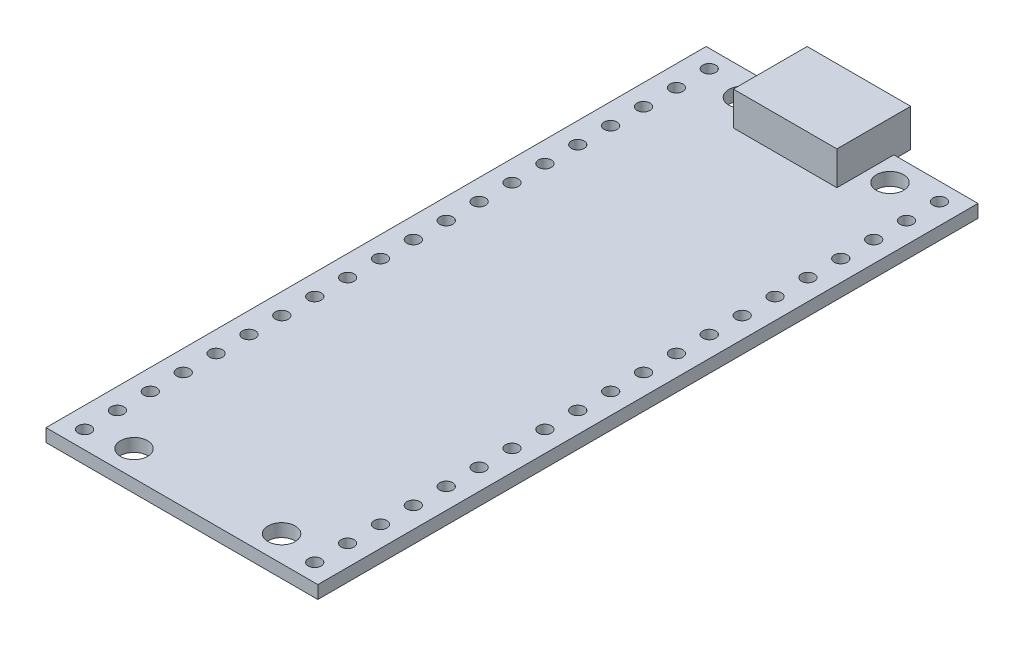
ISO-10303-21;
HEADER;
FILE_DESCRIPTION(('STEP AP214'),'2;1');
FILE_NAME('part.step','',(''),(''),'','','');
FILE_SCHEMA(('AUTOMOTIVE_DESIGN { 1 0 10303 214 1 1 1 1 }'));
ENDSEC;
DATA;
#1=APPLICATION_CONTEXT('core data for automotive mechanical design processes');
#2=APPLICATION_PROTOCOL_DEFINITION('international standard','automotive_design',2000,#1);
#3=PRODUCT_CONTEXT('',#1,'mechanical');
#4=PRODUCT('Part','Part','',(#3));
#5=PRODUCT_RELATED_PRODUCT_CATEGORY('part','',(#4));
#6=PRODUCT_DEFINITION_FORMATION('','',#4);
#7=PRODUCT_DEFINITION_CONTEXT('part definition',#1,'design');
#8=PRODUCT_DEFINITION('design','',#6,#7);
#9=PRODUCT_DEFINITION_SHAPE('','',#8);
#10=(LENGTH_UNIT() NAMED_UNIT(*) SI_UNIT(.MILLI.,.METRE.));
#11=(NAMED_UNIT(*) PLANE_ANGLE_UNIT() SI_UNIT($,.RADIAN.));
#12=(NAMED_UNIT(*) SI_UNIT($,.STERADIAN.) SOLID_ANGLE_UNIT());
#13=UNCERTAINTY_MEASURE_WITH_UNIT(LENGTH_MEASURE(1.E-05),#10,'distance_accuracy_value','');
#14=(GEOMETRIC_REPRESENTATION_CONTEXT(3) GLOBAL_UNCERTAINTY_ASSIGNED_CONTEXT((#13)) GLOBAL_UNIT_ASSIGNED_CONTEXT((#10,
#11,#12)) REPRESENTATION_CONTEXT('',''));
#15=CARTESIAN_POINT('',(0.,0.,0.));
#16=DIRECTION('',(0.,0.,1.));
#17=DIRECTION('',(1.,0.,0.));
#18=AXIS2_PLACEMENT_3D('',#15,#16,#17);
#19=CARTESIAN_POINT('',(8.89,0.,24.13));
#20=DIRECTION('',(0.,1.,0.));
#21=DIRECTION('',(0.,0.,1.));
#22=AXIS2_PLACEMENT_3D('',#19,#20,#21);
#23=CYLINDRICAL_SURFACE('',#22,0.500000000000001);
#24=CARTESIAN_POINT('',(8.89,0.,24.13));
#25=DIRECTION('',(0.,1.,0.));
#26=DIRECTION('',(0.,0.,1.));
#27=AXIS2_PLACEMENT_3D('',#24,#25,#26);
#28=CIRCLE('',#27,0.500000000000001);
#29=CARTESIAN_POINT('',(8.89,0.,24.63));
#30=VERTEX_POINT('',#29);
#31=EDGE_CURVE('E52',#30,#30,#28,.T.);
#32=ORIENTED_EDGE('',*,*,#31,.F.);
#33=EDGE_LOOP('',(#32));
#34=FACE_BOUND('',#33,.T.);
#35=CARTESIAN_POINT('',(8.89,1.,24.13));
#36=DIRECTION('',(0.,1.,0.));
#37=DIRECTION('',(0.,0.,1.));
#38=AXIS2_PLACEMENT_3D('',#35,#36,#37);
#39=CIRCLE('',#38,0.500000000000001);
#40=CARTESIAN_POINT('',(8.89,1.,24.63));
#41=VERTEX_POINT('',#40);
#42=EDGE_CURVE('E11',#41,#41,#39,.T.);
#43=ORIENTED_EDGE('',*,*,#42,.T.);
#44=EDGE_LOOP('',(#43));
#45=FACE_BOUND('',#44,.T.);
#46=ADVANCED_FACE('F45',(#34,#45),#23,.F.);
#47=CARTESIAN_POINT('',(8.89,0.,21.59));
#48=DIRECTION('',(0.,1.,0.));
#49=DIRECTION('',(0.,0.,1.));
#50=AXIS2_PLACEMENT_3D('',#47,#48,#49);
#51=CYLINDRICAL_SURFACE('',#50,0.500000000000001);
#52=CARTESIAN_POINT('',(8.89,0.,21.59));
#53=DIRECTION('',(0.,1.,0.));
#54=DIRECTION('',(0.,0.,1.));
#55=AXIS2_PLACEMENT_3D('',#52,#53,#54);
#56=CIRCLE('',#55,0.500000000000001);
#57=CARTESIAN_POINT('',(8.89,0.,22.09));
#58=VERTEX_POINT('',#57);
#59=EDGE_CURVE('E452',#58,#58,#56,.T.);
#60=ORIENTED_EDGE('',*,*,#59,.F.);
#61=EDGE_LOOP('',(#60));
#62=FACE_BOUND('',#61,.T.);
#63=CARTESIAN_POINT('',(8.89,1.,21.59));
#64=DIRECTION('',(0.,1.,0.));
#65=DIRECTION('',(0.,0.,1.));
#66=AXIS2_PLACEMENT_3D('',#63,#64,#65);
#67=CIRCLE('',#66,0.500000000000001);
#68=CARTESIAN_POINT('',(8.89,1.,22.09));
#69=VERTEX_POINT('',#68);
#70=EDGE_CURVE('E455',#69,#69,#67,.T.);
#71=ORIENTED_EDGE('',*,*,#70,.T.);
#72=EDGE_LOOP('',(#71));
#73=FACE_BOUND('',#72,.T.);
#74=ADVANCED_FACE('F464',(#62,#73),#51,.F.);
#75=CARTESIAN_POINT('',(8.89,0.,19.05));
#76=DIRECTION('',(0.,1.,0.));
#77=DIRECTION('',(0.,0.,1.));
#78=AXIS2_PLACEMENT_3D('',#75,#76,#77);
#79=CYLINDRICAL_SURFACE('',#78,0.500000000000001);
#80=CARTESIAN_POINT('',(8.89,0.,19.05));
#81=DIRECTION('',(0.,1.,0.));
#82=DIRECTION('',(0.,0.,1.));
#83=AXIS2_PLACEMENT_3D('',#80,#81,#82);
#84=CIRCLE('',#83,0.500000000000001);
#85=CARTESIAN_POINT('',(8.89,0.,19.55));
#86=VERTEX_POINT('',#85);
#87=EDGE_CURVE('E446',#86,#86,#84,.T.);
#88=ORIENTED_EDGE('',*,*,#87,.F.);
#89=EDGE_LOOP('',(#88));
#90=FACE_BOUND('',#89,.T.);
#91=CARTESIAN_POINT('',(8.89,1.,19.05));
#92=DIRECTION('',(0.,1.,0.));
#93=DIRECTION('',(0.,0.,1.));
#94=AXIS2_PLACEMENT_3D('',#91,#92,#93);
#95=CIRCLE('',#94,0.500000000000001);
#96=CARTESIAN_POINT('',(8.89,1.,19.55));
#97=VERTEX_POINT('',#96);
#98=EDGE_CURVE('E449',#97,#97,#95,.T.);
#99=ORIENTED_EDGE('',*,*,#98,.T.);
#100=EDGE_LOOP('',(#99));
#101=FACE_BOUND('',#100,.T.);
#102=ADVANCED_FACE('F636',(#90,#101),#79,.F.);
#103=CARTESIAN_POINT('',(8.89,0.,16.51));
#104=DIRECTION('',(0.,1.,0.));
#105=DIRECTION('',(0.,0.,1.));
#106=AXIS2_PLACEMENT_3D('',#103,#104,#105);
#107=CYLINDRICAL_SURFACE('',#106,0.500000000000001);
#108=CARTESIAN_POINT('',(8.89,0.,16.51));
#109=DIRECTION('',(0.,1.,0.));
#110=DIRECTION('',(0.,0.,1.));
#111=AXIS2_PLACEMENT_3D('',#108,#109,#110);
#112=CIRCLE('',#111,0.500000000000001);
#113=CARTESIAN_POINT('',(8.89,0.,17.01));
#114=VERTEX_POINT('',#113);
#115=EDGE_CURVE('E440',#114,#114,#112,.T.);
#116=ORIENTED_EDGE('',*,*,#115,.F.);
#117=EDGE_LOOP('',(#116));
#118=FACE_BOUND('',#117,.T.);
#119=CARTESIAN_POINT('',(8.89,1.,16.51));
#120=DIRECTION('',(0.,1.,0.));
#121=DIRECTION('',(0.,0.,1.));
#122=AXIS2_PLACEMENT_3D('',#119,#120,#121);
#123=CIRCLE('',#122,0.500000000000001);
#124=CARTESIAN_POINT('',(8.89,1.,17.01));
#125=VERTEX_POINT('',#124);
#126=EDGE_CURVE('E443',#125,#125,#123,.T.);
#127=ORIENTED_EDGE('',*,*,#126,.T.);
#128=EDGE_LOOP('',(#127));
#129=FACE_BOUND('',#128,.T.);
#130=ADVANCED_FACE('F632',(#118,#129),#107,.F.);
#131=CARTESIAN_POINT('',(8.89,0.,13.97));
#132=DIRECTION('',(0.,1.,0.));
#133=DIRECTION('',(0.,0.,1.));
#134=AXIS2_PLACEMENT_3D('',#131,#132,#133);
#135=CYLINDRICAL_SURFACE('',#134,0.500000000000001);
#136=CARTESIAN_POINT('',(8.89,0.,13.97));
#137=DIRECTION('',(0.,1.,0.));
#138=DIRECTION('',(0.,0.,1.));
#139=AXIS2_PLACEMENT_3D('',#136,#137,#138);
#140=CIRCLE('',#139,0.500000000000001);
#141=CARTESIAN_POINT('',(8.89,0.,14.47));
#142=VERTEX_POINT('',#141);
#143=EDGE_CURVE('E434',#142,#142,#140,.T.);
#144=ORIENTED_EDGE('',*,*,#143,.F.);
#145=EDGE_LOOP('',(#144));
#146=FACE_BOUND('',#145,.T.);
#147=CARTESIAN_POINT('',(8.89,1.,13.97));
#148=DIRECTION('',(0.,1.,0.));
#149=DIRECTION('',(0.,0.,1.));
#150=AXIS2_PLACEMENT_3D('',#147,#148,#149);
#151=CIRCLE('',#150,0.500000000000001);
#152=CARTESIAN_POINT('',(8.89,1.,14.47));
#153=VERTEX_POINT('',#152);
#154=EDGE_CURVE('E437',#153,#153,#151,.T.);
#155=ORIENTED_EDGE('',*,*,#154,.T.);
#156=EDGE_LOOP('',(#155));
#157=FACE_BOUND('',#156,.T.);
#158=ADVANCED_FACE('F628',(#146,#157),#135,.F.);
#159=CARTESIAN_POINT('',(8.89,0.,11.43));
#160=DIRECTION('',(0.,1.,0.));
#161=DIRECTION('',(0.,0.,1.));
#162=AXIS2_PLACEMENT_3D('',#159,#160,#161);
#163=CYLINDRICAL_SURFACE('',#162,0.500000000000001);
#164=CARTESIAN_POINT('',(8.89,0.,11.43));
#165=DIRECTION('',(0.,1.,0.));
#166=DIRECTION('',(0.,0.,1.));
#167=AXIS2_PLACEMENT_3D('',#164,#165,#166);
#168=CIRCLE('',#167,0.500000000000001);
#169=CARTESIAN_POINT('',(8.89,0.,11.93));
#170=VERTEX_POINT('',#169);
#171=EDGE_CURVE('E428',#170,#170,#168,.T.);
#172=ORIENTED_EDGE('',*,*,#171,.F.);
#173=EDGE_LOOP('',(#172));
#174=FACE_BOUND('',#173,.T.);
#175=CARTESIAN_POINT('',(8.89,1.,11.43));
#176=DIRECTION('',(0.,1.,0.));
#177=DIRECTION('',(0.,0.,1.));
#178=AXIS2_PLACEMENT_3D('',#175,#176,#177);
#179=CIRCLE('',#178,0.500000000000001);
#180=CARTESIAN_POINT('',(8.89,1.,11.93));
#181=VERTEX_POINT('',#180);
#182=EDGE_CURVE('E431',#181,#181,#179,.T.);
#183=ORIENTED_EDGE('',*,*,#182,.T.);
#184=EDGE_LOOP('',(#183));
#185=FACE_BOUND('',#184,.T.);
#186=ADVANCED_FACE('F624',(#174,#185),#163,.F.);
#187=CARTESIAN_POINT('',(8.89,0.,8.89));
#188=DIRECTION('',(0.,1.,0.));
#189=DIRECTION('',(0.,0.,1.));
#190=AXIS2_PLACEMENT_3D('',#187,#188,#189);
#191=CYLINDRICAL_SURFACE('',#190,0.500000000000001);
#192=CARTESIAN_POINT('',(8.89,0.,8.89));
#193=DIRECTION('',(0.,1.,0.));
#194=DIRECTION('',(0.,0.,1.));
#195=AXIS2_PLACEMENT_3D('',#192,#193,#194);
#196=CIRCLE('',#195,0.500000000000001);
#197=CARTESIAN_POINT('',(8.89,0.,9.39));
#198=VERTEX_POINT('',#197);
#199=EDGE_CURVE('E422',#198,#198,#196,.T.);
#200=ORIENTED_EDGE('',*,*,#199,.F.);
#201=EDGE_LOOP('',(#200));
#202=FACE_BOUND('',#201,.T.);
#203=CARTESIAN_POINT('',(8.89,1.,8.89));
#204=DIRECTION('',(0.,1.,0.));
#205=DIRECTION('',(0.,0.,1.));
#206=AXIS2_PLACEMENT_3D('',#203,#204,#205);
#207=CIRCLE('',#206,0.500000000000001);
#208=CARTESIAN_POINT('',(8.89,1.,9.39));
#209=VERTEX_POINT('',#208);
#210=EDGE_CURVE('E425',#209,#209,#207,.T.);
#211=ORIENTED_EDGE('',*,*,#210,.T.);
#212=EDGE_LOOP('',(#211));
#213=FACE_BOUND('',#212,.T.);
#214=ADVANCED_FACE('F620',(#202,#213),#191,.F.);
#215=CARTESIAN_POINT('',(8.89,0.,6.35));
#216=DIRECTION('',(0.,1.,0.));
#217=DIRECTION('',(0.,0.,1.));
#218=AXIS2_PLACEMENT_3D('',#215,#216,#217);
#219=CYLINDRICAL_SURFACE('',#218,0.500000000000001);
#220=CARTESIAN_POINT('',(8.89,0.,6.35));
#221=DIRECTION('',(0.,1.,0.));
#222=DIRECTION('',(0.,0.,1.));
#223=AXIS2_PLACEMENT_3D('',#220,#221,#222);
#224=CIRCLE('',#223,0.500000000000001);
#225=CARTESIAN_POINT('',(8.89,0.,6.85));
#226=VERTEX_POINT('',#225);
#227=EDGE_CURVE('E416',#226,#226,#224,.T.);
#228=ORIENTED_EDGE('',*,*,#227,.F.);
#229=EDGE_LOOP('',(#228));
#230=FACE_BOUND('',#229,.T.);
#231=CARTESIAN_POINT('',(8.89,1.,6.35));
#232=DIRECTION('',(0.,1.,0.));
#233=DIRECTION('',(0.,0.,1.));
#234=AXIS2_PLACEMENT_3D('',#231,#232,#233);
#235=CIRCLE('',#234,0.500000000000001);
#236=CARTESIAN_POINT('',(8.89,1.,6.85));
#237=VERTEX_POINT('',#236);
#238=EDGE_CURVE('E419',#237,#237,#235,.T.);
#239=ORIENTED_EDGE('',*,*,#238,.T.);
#240=EDGE_LOOP('',(#239));
#241=FACE_BOUND('',#240,.T.);
#242=ADVANCED_FACE('F616',(#230,#241),#219,.F.);
#243=CARTESIAN_POINT('',(8.89,0.,3.81));
#244=DIRECTION('',(0.,1.,0.));
#245=DIRECTION('',(0.,0.,1.));
#246=AXIS2_PLACEMENT_3D('',#243,#244,#245);
#247=CYLINDRICAL_SURFACE('',#246,0.500000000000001);
#248=CARTESIAN_POINT('',(8.89,0.,3.81));
#249=DIRECTION('',(0.,1.,0.));
#250=DIRECTION('',(0.,0.,1.));
#251=AXIS2_PLACEMENT_3D('',#248,#249,#250);
#252=CIRCLE('',#251,0.500000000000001);
#253=CARTESIAN_POINT('',(8.89,0.,4.31));
#254=VERTEX_POINT('',#253);
#255=EDGE_CURVE('E410',#254,#254,#252,.T.);
#256=ORIENTED_EDGE('',*,*,#255,.F.);
#257=EDGE_LOOP('',(#256));
#258=FACE_BOUND('',#257,.T.);
#259=CARTESIAN_POINT('',(8.89,1.,3.81));
#260=DIRECTION('',(0.,1.,0.));
#261=DIRECTION('',(0.,0.,1.));
#262=AXIS2_PLACEMENT_3D('',#259,#260,#261);
#263=CIRCLE('',#262,0.500000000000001);
#264=CARTESIAN_POINT('',(8.89,1.,4.31));
#265=VERTEX_POINT('',#264);
#266=EDGE_CURVE('E413',#265,#265,#263,.T.);
#267=ORIENTED_EDGE('',*,*,#266,.T.);
#268=EDGE_LOOP('',(#267));
#269=FACE_BOUND('',#268,.T.);
#270=ADVANCED_FACE('F612',(#258,#269),#247,.F.);
#271=CARTESIAN_POINT('',(8.89,0.,1.27));
#272=DIRECTION('',(0.,1.,0.));
#273=DIRECTION('',(0.,0.,1.));
#274=AXIS2_PLACEMENT_3D('',#271,#272,#273);
#275=CYLINDRICAL_SURFACE('',#274,0.500000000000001);
#276=CARTESIAN_POINT('',(8.89,0.,1.27));
#277=DIRECTION('',(0.,1.,0.));
#278=DIRECTION('',(0.,0.,1.));
#279=AXIS2_PLACEMENT_3D('',#276,#277,#278);
#280=CIRCLE('',#279,0.500000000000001);
#281=CARTESIAN_POINT('',(8.89,0.,1.77));
#282=VERTEX_POINT('',#281);
#283=EDGE_CURVE('E404',#282,#282,#280,.T.);
#284=ORIENTED_EDGE('',*,*,#283,.F.);
#285=EDGE_LOOP('',(#284));
#286=FACE_BOUND('',#285,.T.);
#287=CARTESIAN_POINT('',(8.89,1.,1.27));
#288=DIRECTION('',(0.,1.,0.));
#289=DIRECTION('',(0.,0.,1.));
#290=AXIS2_PLACEMENT_3D('',#287,#288,#289);
#291=CIRCLE('',#290,0.500000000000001);
#292=CARTESIAN_POINT('',(8.89,1.,1.77));
#293=VERTEX_POINT('',#292);
#294=EDGE_CURVE('E407',#293,#293,#291,.T.);
#295=ORIENTED_EDGE('',*,*,#294,.T.);
#296=EDGE_LOOP('',(#295));
#297=FACE_BOUND('',#296,.T.);
#298=ADVANCED_FACE('F608',(#286,#297),#275,.F.);
#299=CARTESIAN_POINT('',(8.89,0.,-1.27));
#300=DIRECTION('',(0.,1.,0.));
#301=DIRECTION('',(0.,0.,1.));
#302=AXIS2_PLACEMENT_3D('',#299,#300,#301);
#303=CYLINDRICAL_SURFACE('',#302,0.500000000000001);
#304=CARTESIAN_POINT('',(8.89,0.,-1.27));
#305=DIRECTION('',(0.,1.,0.));
#306=DIRECTION('',(0.,0.,1.));
#307=AXIS2_PLACEMENT_3D('',#304,#305,#306);
#308=CIRCLE('',#307,0.500000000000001);
#309=CARTESIAN_POINT('',(8.89,0.,-0.769999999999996));
#310=VERTEX_POINT('',#309);
#311=EDGE_CURVE('E398',#310,#310,#308,.T.);
#312=ORIENTED_EDGE('',*,*,#311,.F.);
#313=EDGE_LOOP('',(#312));
#314=FACE_BOUND('',#313,.T.);
#315=CARTESIAN_POINT('',(8.89,1.,-1.27));
#316=DIRECTION('',(0.,1.,0.));
#317=DIRECTION('',(0.,0.,1.));
#318=AXIS2_PLACEMENT_3D('',#315,#316,#317);
#319=CIRCLE('',#318,0.500000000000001);
#320=CARTESIAN_POINT('',(8.89,1.,-0.769999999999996));
#321=VERTEX_POINT('',#320);
#322=EDGE_CURVE('E401',#321,#321,#319,.T.);
#323=ORIENTED_EDGE('',*,*,#322,.T.);
#324=EDGE_LOOP('',(#323));
#325=FACE_BOUND('',#324,.T.);
#326=ADVANCED_FACE('F604',(#314,#325),#303,.F.);
#327=CARTESIAN_POINT('',(8.89,0.,-3.81));
#328=DIRECTION('',(0.,1.,0.));
#329=DIRECTION('',(0.,0.,1.));
#330=AXIS2_PLACEMENT_3D('',#327,#328,#329);
#331=CYLINDRICAL_SURFACE('',#330,0.500000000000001);
#332=CARTESIAN_POINT('',(8.89,0.,-3.81));
#333=DIRECTION('',(0.,1.,0.));
#334=DIRECTION('',(0.,0.,1.));
#335=AXIS2_PLACEMENT_3D('',#332,#333,#334);
#336=CIRCLE('',#335,0.500000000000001);
#337=CARTESIAN_POINT('',(8.89,0.,-3.31));
#338=VERTEX_POINT('',#337);
#339=EDGE_CURVE('E392',#338,#338,#336,.T.);
#340=ORIENTED_EDGE('',*,*,#339,.F.);
#341=EDGE_LOOP('',(#340));
#342=FACE_BOUND('',#341,.T.);
#343=CARTESIAN_POINT('',(8.89,1.,-3.81));
#344=DIRECTION('',(0.,1.,0.));
#345=DIRECTION('',(0.,0.,1.));
#346=AXIS2_PLACEMENT_3D('',#343,#344,#345);
#347=CIRCLE('',#346,0.500000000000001);
#348=CARTESIAN_POINT('',(8.89,1.,-3.31));
#349=VERTEX_POINT('',#348);
#350=EDGE_CURVE('E395',#349,#349,#347,.T.);
#351=ORIENTED_EDGE('',*,*,#350,.T.);
#352=EDGE_LOOP('',(#351));
#353=FACE_BOUND('',#352,.T.);
#354=ADVANCED_FACE('F600',(#342,#353),#331,.F.);
#355=CARTESIAN_POINT('',(8.89,0.,-6.35));
#356=DIRECTION('',(0.,1.,0.));
#357=DIRECTION('',(0.,0.,1.));
#358=AXIS2_PLACEMENT_3D('',#355,#356,#357);
#359=CYLINDRICAL_SURFACE('',#358,0.500000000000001);
#360=CARTESIAN_POINT('',(8.89,0.,-6.35));
#361=DIRECTION('',(0.,1.,0.));
#362=DIRECTION('',(0.,0.,1.));
#363=AXIS2_PLACEMENT_3D('',#360,#361,#362);
#364=CIRCLE('',#363,0.500000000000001);
#365=CARTESIAN_POINT('',(8.89,0.,-5.85));
#366=VERTEX_POINT('',#365);
#367=EDGE_CURVE('E386',#366,#366,#364,.T.);
#368=ORIENTED_EDGE('',*,*,#367,.F.);
#369=EDGE_LOOP('',(#368));
#370=FACE_BOUND('',#369,.T.);
#371=CARTESIAN_POINT('',(8.89,1.,-6.35));
#372=DIRECTION('',(0.,1.,0.));
#373=DIRECTION('',(0.,0.,1.));
#374=AXIS2_PLACEMENT_3D('',#371,#372,#373);
#375=CIRCLE('',#374,0.500000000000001);
#376=CARTESIAN_POINT('',(8.89,1.,-5.85));
#377=VERTEX_POINT('',#376);
#378=EDGE_CURVE('E389',#377,#377,#375,.T.);
#379=ORIENTED_EDGE('',*,*,#378,.T.);
#380=EDGE_LOOP('',(#379));
#381=FACE_BOUND('',#380,.T.);
#382=ADVANCED_FACE('F596',(#370,#381),#359,.F.);
#383=CARTESIAN_POINT('',(8.89,0.,-8.89));
#384=DIRECTION('',(0.,1.,0.));
#385=DIRECTION('',(0.,0.,1.));
#386=AXIS2_PLACEMENT_3D('',#383,#384,#385);
#387=CYLINDRICAL_SURFACE('',#386,0.500000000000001);
#388=CARTESIAN_POINT('',(8.89,0.,-8.89));
#389=DIRECTION('',(0.,1.,0.));
#390=DIRECTION('',(0.,0.,1.));
#391=AXIS2_PLACEMENT_3D('',#388,#389,#390);
#392=CIRCLE('',#391,0.500000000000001);
#393=CARTESIAN_POINT('',(8.89,0.,-8.39));
#394=VERTEX_POINT('',#393);
#395=EDGE_CURVE('E380',#394,#394,#392,.T.);
#396=ORIENTED_EDGE('',*,*,#395,.F.);
#397=EDGE_LOOP('',(#396));
#398=FACE_BOUND('',#397,.T.);
#399=CARTESIAN_POINT('',(8.89,1.,-8.89));
#400=DIRECTION('',(0.,1.,0.));
#401=DIRECTION('',(0.,0.,1.));
#402=AXIS2_PLACEMENT_3D('',#399,#400,#401);
#403=CIRCLE('',#402,0.500000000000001);
#404=CARTESIAN_POINT('',(8.89,1.,-8.39));
#405=VERTEX_POINT('',#404);
#406=EDGE_CURVE('E383',#405,#405,#403,.T.);
#407=ORIENTED_EDGE('',*,*,#406,.T.);
#408=EDGE_LOOP('',(#407));
#409=FACE_BOUND('',#408,.T.);
#410=ADVANCED_FACE('F592',(#398,#409),#387,.F.);
#411=CARTESIAN_POINT('',(8.89,0.,-11.43));
#412=DIRECTION('',(0.,1.,0.));
#413=DIRECTION('',(0.,0.,1.));
#414=AXIS2_PLACEMENT_3D('',#411,#412,#413);
#415=CYLINDRICAL_SURFACE('',#414,0.500000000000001);
#416=CARTESIAN_POINT('',(8.89,0.,-11.43));
#417=DIRECTION('',(0.,1.,0.));
#418=DIRECTION('',(0.,0.,1.));
#419=AXIS2_PLACEMENT_3D('',#416,#417,#418);
#420=CIRCLE('',#419,0.500000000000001);
#421=CARTESIAN_POINT('',(8.89,0.,-10.93));
#422=VERTEX_POINT('',#421);
#423=EDGE_CURVE('E374',#422,#422,#420,.T.);
#424=ORIENTED_EDGE('',*,*,#423,.F.);
#425=EDGE_LOOP('',(#424));
#426=FACE_BOUND('',#425,.T.);
#427=CARTESIAN_POINT('',(8.89,1.,-11.43));
#428=DIRECTION('',(0.,1.,0.));
#429=DIRECTION('',(0.,0.,1.));
#430=AXIS2_PLACEMENT_3D('',#427,#428,#429);
#431=CIRCLE('',#430,0.500000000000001);
#432=CARTESIAN_POINT('',(8.89,1.,-10.93));
#433=VERTEX_POINT('',#432);
#434=EDGE_CURVE('E377',#433,#433,#431,.T.);
#435=ORIENTED_EDGE('',*,*,#434,.T.);
#436=EDGE_LOOP('',(#435));
#437=FACE_BOUND('',#436,.T.);
#438=ADVANCED_FACE('F588',(#426,#437),#415,.F.);
#439=CARTESIAN_POINT('',(8.89,0.,-13.97));
#440=DIRECTION('',(0.,1.,0.));
#441=DIRECTION('',(0.,0.,1.));
#442=AXIS2_PLACEMENT_3D('',#439,#440,#441);
#443=CYLINDRICAL_SURFACE('',#442,0.500000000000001);
#444=CARTESIAN_POINT('',(8.89,0.,-13.97));
#445=DIRECTION('',(0.,1.,0.));
#446=DIRECTION('',(0.,0.,1.));
#447=AXIS2_PLACEMENT_3D('',#444,#445,#446);
#448=CIRCLE('',#447,0.500000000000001);
#449=CARTESIAN_POINT('',(8.89,0.,-13.47));
#450=VERTEX_POINT('',#449);
#451=EDGE_CURVE('E368',#450,#450,#448,.T.);
#452=ORIENTED_EDGE('',*,*,#451,.F.);
#453=EDGE_LOOP('',(#452));
#454=FACE_BOUND('',#453,.T.);
#455=CARTESIAN_POINT('',(8.89,1.,-13.97));
#456=DIRECTION('',(0.,1.,0.));
#457=DIRECTION('',(0.,0.,1.));
#458=AXIS2_PLACEMENT_3D('',#455,#456,#457);
#459=CIRCLE('',#458,0.500000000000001);
#460=CARTESIAN_POINT('',(8.89,1.,-13.47));
#461=VERTEX_POINT('',#460);
#462=EDGE_CURVE('E371',#461,#461,#459,.T.);
#463=ORIENTED_EDGE('',*,*,#462,.T.);
#464=EDGE_LOOP('',(#463));
#465=FACE_BOUND('',#464,.T.);
#466=ADVANCED_FACE('F584',(#454,#465),#443,.F.);
#467=CARTESIAN_POINT('',(8.89,0.,-16.51));
#468=DIRECTION('',(0.,1.,0.));
#469=DIRECTION('',(0.,0.,1.));
#470=AXIS2_PLACEMENT_3D('',#467,#468,#469);
#471=CYLINDRICAL_SURFACE('',#470,0.500000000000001);
#472=CARTESIAN_POINT('',(8.89,0.,-16.51));
#473=DIRECTION('',(0.,1.,0.));
#474=DIRECTION('',(0.,0.,1.));
#475=AXIS2_PLACEMENT_3D('',#472,#473,#474);
#476=CIRCLE('',#475,0.500000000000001);
#477=CARTESIAN_POINT('',(8.89,0.,-16.01));
#478=VERTEX_POINT('',#477);
#479=EDGE_CURVE('E362',#478,#478,#476,.T.);
#480=ORIENTED_EDGE('',*,*,#479,.F.);
#481=EDGE_LOOP('',(#480));
#482=FACE_BOUND('',#481,.T.);
#483=CARTESIAN_POINT('',(8.89,1.,-16.51));
#484=DIRECTION('',(0.,1.,0.));
#485=DIRECTION('',(0.,0.,1.));
#486=AXIS2_PLACEMENT_3D('',#483,#484,#485);
#487=CIRCLE('',#486,0.500000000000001);
#488=CARTESIAN_POINT('',(8.89,1.,-16.01));
#489=VERTEX_POINT('',#488);
#490=EDGE_CURVE('E365',#489,#489,#487,.T.);
#491=ORIENTED_EDGE('',*,*,#490,.T.);
#492=EDGE_LOOP('',(#491));
#493=FACE_BOUND('',#492,.T.);
#494=ADVANCED_FACE('F580',(#482,#493),#471,.F.);
#495=CARTESIAN_POINT('',(8.89,0.,-19.05));
#496=DIRECTION('',(0.,1.,0.));
#497=DIRECTION('',(0.,0.,1.));
#498=AXIS2_PLACEMENT_3D('',#495,#496,#497);
#499=CYLINDRICAL_SURFACE('',#498,0.500000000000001);
#500=CARTESIAN_POINT('',(8.89,0.,-19.05));
#501=DIRECTION('',(0.,1.,0.));
#502=DIRECTION('',(0.,0.,1.));
#503=AXIS2_PLACEMENT_3D('',#500,#501,#502);
#504=CIRCLE('',#503,0.500000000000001);
#505=CARTESIAN_POINT('',(8.89,0.,-18.55));
#506=VERTEX_POINT('',#505);
#507=EDGE_CURVE('E356',#506,#506,#504,.T.);
#508=ORIENTED_EDGE('',*,*,#507,.F.);
#509=EDGE_LOOP('',(#508));
#510=FACE_BOUND('',#509,.T.);
#511=CARTESIAN_POINT('',(8.89,1.,-19.05));
#512=DIRECTION('',(0.,1.,0.));
#513=DIRECTION('',(0.,0.,1.));
#514=AXIS2_PLACEMENT_3D('',#511,#512,#513);
#515=CIRCLE('',#514,0.500000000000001);
#516=CARTESIAN_POINT('',(8.89,1.,-18.55));
#517=VERTEX_POINT('',#516);
#518=EDGE_CURVE('E359',#517,#517,#515,.T.);
#519=ORIENTED_EDGE('',*,*,#518,.T.);
#520=EDGE_LOOP('',(#519));
#521=FACE_BOUND('',#520,.T.);
#522=ADVANCED_FACE('F576',(#510,#521),#499,.F.);
#523=CARTESIAN_POINT('',(8.89,0.,-21.59));
#524=DIRECTION('',(0.,1.,0.));
#525=DIRECTION('',(0.,0.,1.));
#526=AXIS2_PLACEMENT_3D('',#523,#524,#525);
#527=CYLINDRICAL_SURFACE('',#526,0.500000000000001);
#528=CARTESIAN_POINT('',(8.89,0.,-21.59));
#529=DIRECTION('',(0.,1.,0.));
#530=DIRECTION('',(0.,0.,1.));
#531=AXIS2_PLACEMENT_3D('',#528,#529,#530);
#532=CIRCLE('',#531,0.500000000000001);
#533=CARTESIAN_POINT('',(8.89,0.,-21.09));
#534=VERTEX_POINT('',#533);
#535=EDGE_CURVE('E350',#534,#534,#532,.T.);
#536=ORIENTED_EDGE('',*,*,#535,.F.);
#537=EDGE_LOOP('',(#536));
#538=FACE_BOUND('',#537,.T.);
#539=CARTESIAN_POINT('',(8.89,1.,-21.59));
#540=DIRECTION('',(0.,1.,0.));
#541=DIRECTION('',(0.,0.,1.));
#542=AXIS2_PLACEMENT_3D('',#539,#540,#541);
#543=CIRCLE('',#542,0.500000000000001);
#544=CARTESIAN_POINT('',(8.89,1.,-21.09));
#545=VERTEX_POINT('',#544);
#546=EDGE_CURVE('E353',#545,#545,#543,.T.);
#547=ORIENTED_EDGE('',*,*,#546,.T.);
#548=EDGE_LOOP('',(#547));
#549=FACE_BOUND('',#548,.T.);
#550=ADVANCED_FACE('F572',(#538,#549),#527,.F.);
#551=CARTESIAN_POINT('',(8.89,0.,-24.13));
#552=DIRECTION('',(0.,1.,0.));
#553=DIRECTION('',(0.,0.,1.));
#554=AXIS2_PLACEMENT_3D('',#551,#552,#553);
#555=CYLINDRICAL_SURFACE('',#554,0.500000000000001);
#556=CARTESIAN_POINT('',(8.89,0.,-24.13));
#557=DIRECTION('',(0.,1.,0.));
#558=DIRECTION('',(0.,0.,1.));
#559=AXIS2_PLACEMENT_3D('',#556,#557,#558);
#560=CIRCLE('',#559,0.500000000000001);
#561=CARTESIAN_POINT('',(8.89,0.,-23.63));
#562=VERTEX_POINT('',#561);
#563=EDGE_CURVE('E344',#562,#562,#560,.T.);
#564=ORIENTED_EDGE('',*,*,#563,.F.);
#565=EDGE_LOOP('',(#564));
#566=FACE_BOUND('',#565,.T.);
#567=CARTESIAN_POINT('',(8.89,1.,-24.13));
#568=DIRECTION('',(0.,1.,0.));
#569=DIRECTION('',(0.,0.,1.));
#570=AXIS2_PLACEMENT_3D('',#567,#568,#569);
#571=CIRCLE('',#570,0.500000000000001);
#572=CARTESIAN_POINT('',(8.89,1.,-23.63));
#573=VERTEX_POINT('',#572);
#574=EDGE_CURVE('E347',#573,#573,#571,.T.);
#575=ORIENTED_EDGE('',*,*,#574,.T.);
#576=EDGE_LOOP('',(#575));
#577=FACE_BOUND('',#576,.T.);
#578=ADVANCED_FACE('F568',(#566,#577),#555,.F.);
#579=CARTESIAN_POINT('',(-8.89,0.,24.13));
#580=DIRECTION('',(0.,1.,0.));
#581=DIRECTION('',(0.,0.,1.));
#582=AXIS2_PLACEMENT_3D('',#579,#580,#581);
#583=CYLINDRICAL_SURFACE('',#582,0.500000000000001);
#584=CARTESIAN_POINT('',(-8.89,0.,24.13));
#585=DIRECTION('',(0.,1.,0.));
#586=DIRECTION('',(0.,0.,1.));
#587=AXIS2_PLACEMENT_3D('',#584,#585,#586);
#588=CIRCLE('',#587,0.500000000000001);
#589=CARTESIAN_POINT('',(-8.89,0.,24.63));
#590=VERTEX_POINT('',#589);
#591=EDGE_CURVE('E338',#590,#590,#588,.T.);
#592=ORIENTED_EDGE('',*,*,#591,.F.);
#593=EDGE_LOOP('',(#592));
#594=FACE_BOUND('',#593,.T.);
#595=CARTESIAN_POINT('',(-8.89,1.,24.13));
#596=DIRECTION('',(0.,1.,0.));
#597=DIRECTION('',(0.,0.,1.));
#598=AXIS2_PLACEMENT_3D('',#595,#596,#597);
#599=CIRCLE('',#598,0.500000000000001);
#600=CARTESIAN_POINT('',(-8.89,1.,24.63));
#601=VERTEX_POINT('',#600);
#602=EDGE_CURVE('E341',#601,#601,#599,.T.);
#603=ORIENTED_EDGE('',*,*,#602,.T.);
#604=EDGE_LOOP('',(#603));
#605=FACE_BOUND('',#604,.T.);
#606=ADVANCED_FACE('F564',(#594,#605),#583,.F.);
#607=CARTESIAN_POINT('',(-8.89,0.,21.59));
#608=DIRECTION('',(0.,1.,0.));
#609=DIRECTION('',(0.,0.,1.));
#610=AXIS2_PLACEMENT_3D('',#607,#608,#609);
#611=CYLINDRICAL_SURFACE('',#610,0.500000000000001);
#612=CARTESIAN_POINT('',(-8.89,0.,21.59));
#613=DIRECTION('',(0.,1.,0.));
#614=DIRECTION('',(0.,0.,1.));
#615=AXIS2_PLACEMENT_3D('',#612,#613,#614);
#616=CIRCLE('',#615,0.500000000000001);
#617=CARTESIAN_POINT('',(-8.89,0.,22.09));
#618=VERTEX_POINT('',#617);
#619=EDGE_CURVE('E332',#618,#618,#616,.T.);
#620=ORIENTED_EDGE('',*,*,#619,.F.);
#621=EDGE_LOOP('',(#620));
#622=FACE_BOUND('',#621,.T.);
#623=CARTESIAN_POINT('',(-8.89,1.,21.59));
#624=DIRECTION('',(0.,1.,0.));
#625=DIRECTION('',(0.,0.,1.));
#626=AXIS2_PLACEMENT_3D('',#623,#624,#625);
#627=CIRCLE('',#626,0.500000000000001);
#628=CARTESIAN_POINT('',(-8.89,1.,22.09));
#629=VERTEX_POINT('',#628);
#630=EDGE_CURVE('E335',#629,#629,#627,.T.);
#631=ORIENTED_EDGE('',*,*,#630,.T.);
#632=EDGE_LOOP('',(#631));
#633=FACE_BOUND('',#632,.T.);
#634=ADVANCED_FACE('F560',(#622,#633),#611,.F.);
#635=CARTESIAN_POINT('',(-8.89,0.,19.05));
#636=DIRECTION('',(0.,1.,0.));
#637=DIRECTION('',(0.,0.,1.));
#638=AXIS2_PLACEMENT_3D('',#635,#636,#637);
#639=CYLINDRICAL_SURFACE('',#638,0.500000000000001);
#640=CARTESIAN_POINT('',(-8.89,0.,19.05));
#641=DIRECTION('',(0.,1.,0.));
#642=DIRECTION('',(0.,0.,1.));
#643=AXIS2_PLACEMENT_3D('',#640,#641,#642);
#644=CIRCLE('',#643,0.500000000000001);
#645=CARTESIAN_POINT('',(-8.89,0.,19.55));
#646=VERTEX_POINT('',#645);
#647=EDGE_CURVE('E326',#646,#646,#644,.T.);
#648=ORIENTED_EDGE('',*,*,#647,.F.);
#649=EDGE_LOOP('',(#648));
#650=FACE_BOUND('',#649,.T.);
#651=CARTESIAN_POINT('',(-8.89,1.,19.05));
#652=DIRECTION('',(0.,1.,0.));
#653=DIRECTION('',(0.,0.,1.));
#654=AXIS2_PLACEMENT_3D('',#651,#652,#653);
#655=CIRCLE('',#654,0.500000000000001);
#656=CARTESIAN_POINT('',(-8.89,1.,19.55));
#657=VERTEX_POINT('',#656);
#658=EDGE_CURVE('E329',#657,#657,#655,.T.);
#659=ORIENTED_EDGE('',*,*,#658,.T.);
#660=EDGE_LOOP('',(#659));
#661=FACE_BOUND('',#660,.T.);
#662=ADVANCED_FACE('F556',(#650,#661),#639,.F.);
#663=CARTESIAN_POINT('',(-8.89,0.,16.51));
#664=DIRECTION('',(0.,1.,0.));
#665=DIRECTION('',(0.,0.,1.));
#666=AXIS2_PLACEMENT_3D('',#663,#664,#665);
#667=CYLINDRICAL_SURFACE('',#666,0.500000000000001);
#668=CARTESIAN_POINT('',(-8.89,0.,16.51));
#669=DIRECTION('',(0.,1.,0.));
#670=DIRECTION('',(0.,0.,1.));
#671=AXIS2_PLACEMENT_3D('',#668,#669,#670);
#672=CIRCLE('',#671,0.500000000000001);
#673=CARTESIAN_POINT('',(-8.89,0.,17.01));
#674=VERTEX_POINT('',#673);
#675=EDGE_CURVE('E320',#674,#674,#672,.T.);
#676=ORIENTED_EDGE('',*,*,#675,.F.);
#677=EDGE_LOOP('',(#676));
#678=FACE_BOUND('',#677,.T.);
#679=CARTESIAN_POINT('',(-8.89,1.,16.51));
#680=DIRECTION('',(0.,1.,0.));
#681=DIRECTION('',(0.,0.,1.));
#682=AXIS2_PLACEMENT_3D('',#679,#680,#681);
#683=CIRCLE('',#682,0.500000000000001);
#684=CARTESIAN_POINT('',(-8.89,1.,17.01));
#685=VERTEX_POINT('',#684);
#686=EDGE_CURVE('E323',#685,#685,#683,.T.);
#687=ORIENTED_EDGE('',*,*,#686,.T.);
#688=EDGE_LOOP('',(#687));
#689=FACE_BOUND('',#688,.T.);
#690=ADVANCED_FACE('F552',(#678,#689),#667,.F.);
#691=CARTESIAN_POINT('',(-8.89,0.,13.97));
#692=DIRECTION('',(0.,1.,0.));
#693=DIRECTION('',(0.,0.,1.));
#694=AXIS2_PLACEMENT_3D('',#691,#692,#693);
#695=CYLINDRICAL_SURFACE('',#694,0.500000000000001);
#696=CARTESIAN_POINT('',(-8.89,0.,13.97));
#697=DIRECTION('',(0.,1.,0.));
#698=DIRECTION('',(0.,0.,1.));
#699=AXIS2_PLACEMENT_3D('',#696,#697,#698);
#700=CIRCLE('',#699,0.500000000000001);
#701=CARTESIAN_POINT('',(-8.89,0.,14.47));
#702=VERTEX_POINT('',#701);
#703=EDGE_CURVE('E314',#702,#702,#700,.T.);
#704=ORIENTED_EDGE('',*,*,#703,.F.);
#705=EDGE_LOOP('',(#704));
#706=FACE_BOUND('',#705,.T.);
#707=CARTESIAN_POINT('',(-8.89,1.,13.97));
#708=DIRECTION('',(0.,1.,0.));
#709=DIRECTION('',(0.,0.,1.));
#710=AXIS2_PLACEMENT_3D('',#707,#708,#709);
#711=CIRCLE('',#710,0.500000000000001);
#712=CARTESIAN_POINT('',(-8.89,1.,14.47));
#713=VERTEX_POINT('',#712);
#714=EDGE_CURVE('E317',#713,#713,#711,.T.);
#715=ORIENTED_EDGE('',*,*,#714,.T.);
#716=EDGE_LOOP('',(#715));
#717=FACE_BOUND('',#716,.T.);
#718=ADVANCED_FACE('F548',(#706,#717),#695,.F.);
#719=CARTESIAN_POINT('',(-8.89,0.,11.43));
#720=DIRECTION('',(0.,1.,0.));
#721=DIRECTION('',(0.,0.,1.));
#722=AXIS2_PLACEMENT_3D('',#719,#720,#721);
#723=CYLINDRICAL_SURFACE('',#722,0.500000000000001);
#724=CARTESIAN_POINT('',(-8.89,0.,11.43));
#725=DIRECTION('',(0.,1.,0.));
#726=DIRECTION('',(0.,0.,1.));
#727=AXIS2_PLACEMENT_3D('',#724,#725,#726);
#728=CIRCLE('',#727,0.500000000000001);
#729=CARTESIAN_POINT('',(-8.89,0.,11.93));
#730=VERTEX_POINT('',#729);
#731=EDGE_CURVE('E308',#730,#730,#728,.T.);
#732=ORIENTED_EDGE('',*,*,#731,.F.);
#733=EDGE_LOOP('',(#732));
#734=FACE_BOUND('',#733,.T.);
#735=CARTESIAN_POINT('',(-8.89,1.,11.43));
#736=DIRECTION('',(0.,1.,0.));
#737=DIRECTION('',(0.,0.,1.));
#738=AXIS2_PLACEMENT_3D('',#735,#736,#737);
#739=CIRCLE('',#738,0.500000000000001);
#740=CARTESIAN_POINT('',(-8.89,1.,11.93));
#741=VERTEX_POINT('',#740);
#742=EDGE_CURVE('E311',#741,#741,#739,.T.);
#743=ORIENTED_EDGE('',*,*,#742,.T.);
#744=EDGE_LOOP('',(#743));
#745=FACE_BOUND('',#744,.T.);
#746=ADVANCED_FACE('F544',(#734,#745),#723,.F.);
#747=CARTESIAN_POINT('',(-8.89,0.,8.89));
#748=DIRECTION('',(0.,1.,0.));
#749=DIRECTION('',(0.,0.,1.));
#750=AXIS2_PLACEMENT_3D('',#747,#748,#749);
#751=CYLINDRICAL_SURFACE('',#750,0.500000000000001);
#752=CARTESIAN_POINT('',(-8.89,0.,8.89));
#753=DIRECTION('',(0.,1.,0.));
#754=DIRECTION('',(0.,0.,1.));
#755=AXIS2_PLACEMENT_3D('',#752,#753,#754);
#756=CIRCLE('',#755,0.500000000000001);
#757=CARTESIAN_POINT('',(-8.89,0.,9.39));
#758=VERTEX_POINT('',#757);
#759=EDGE_CURVE('E302',#758,#758,#756,.T.);
#760=ORIENTED_EDGE('',*,*,#759,.F.);
#761=EDGE_LOOP('',(#760));
#762=FACE_BOUND('',#761,.T.);
#763=CARTESIAN_POINT('',(-8.89,1.,8.89));
#764=DIRECTION('',(0.,1.,0.));
#765=DIRECTION('',(0.,0.,1.));
#766=AXIS2_PLACEMENT_3D('',#763,#764,#765);
#767=CIRCLE('',#766,0.500000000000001);
#768=CARTESIAN_POINT('',(-8.89,1.,9.39));
#769=VERTEX_POINT('',#768);
#770=EDGE_CURVE('E305',#769,#769,#767,.T.);
#771=ORIENTED_EDGE('',*,*,#770,.T.);
#772=EDGE_LOOP('',(#771));
#773=FACE_BOUND('',#772,.T.);
#774=ADVANCED_FACE('F540',(#762,#773),#751,.F.);
#775=CARTESIAN_POINT('',(-8.89,0.,6.35));
#776=DIRECTION('',(0.,1.,0.));
#777=DIRECTION('',(0.,0.,1.));
#778=AXIS2_PLACEMENT_3D('',#775,#776,#777);
#779=CYLINDRICAL_SURFACE('',#778,0.500000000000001);
#780=CARTESIAN_POINT('',(-8.89,0.,6.35));
#781=DIRECTION('',(0.,1.,0.));
#782=DIRECTION('',(0.,0.,1.));
#783=AXIS2_PLACEMENT_3D('',#780,#781,#782);
#784=CIRCLE('',#783,0.500000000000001);
#785=CARTESIAN_POINT('',(-8.89,0.,6.85));
#786=VERTEX_POINT('',#785);
#787=EDGE_CURVE('E296',#786,#786,#784,.T.);
#788=ORIENTED_EDGE('',*,*,#787,.F.);
#789=EDGE_LOOP('',(#788));
#790=FACE_BOUND('',#789,.T.);
#791=CARTESIAN_POINT('',(-8.89,1.,6.35));
#792=DIRECTION('',(0.,1.,0.));
#793=DIRECTION('',(0.,0.,1.));
#794=AXIS2_PLACEMENT_3D('',#791,#792,#793);
#795=CIRCLE('',#794,0.500000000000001);
#796=CARTESIAN_POINT('',(-8.89,1.,6.85));
#797=VERTEX_POINT('',#796);
#798=EDGE_CURVE('E299',#797,#797,#795,.T.);
#799=ORIENTED_EDGE('',*,*,#798,.T.);
#800=EDGE_LOOP('',(#799));
#801=FACE_BOUND('',#800,.T.);
#802=ADVANCED_FACE('F536',(#790,#801),#779,.F.);
#803=CARTESIAN_POINT('',(-8.89,0.,3.81));
#804=DIRECTION('',(0.,1.,0.));
#805=DIRECTION('',(0.,0.,1.));
#806=AXIS2_PLACEMENT_3D('',#803,#804,#805);
#807=CYLINDRICAL_SURFACE('',#806,0.500000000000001);
#808=CARTESIAN_POINT('',(-8.89,0.,3.81));
#809=DIRECTION('',(0.,1.,0.));
#810=DIRECTION('',(0.,0.,1.));
#811=AXIS2_PLACEMENT_3D('',#808,#809,#810);
#812=CIRCLE('',#811,0.500000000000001);
#813=CARTESIAN_POINT('',(-8.89,0.,4.31));
#814=VERTEX_POINT('',#813);
#815=EDGE_CURVE('E290',#814,#814,#812,.T.);
#816=ORIENTED_EDGE('',*,*,#815,.F.);
#817=EDGE_LOOP('',(#816));
#818=FACE_BOUND('',#817,.T.);
#819=CARTESIAN_POINT('',(-8.89,1.,3.81));
#820=DIRECTION('',(0.,1.,0.));
#821=DIRECTION('',(0.,0.,1.));
#822=AXIS2_PLACEMENT_3D('',#819,#820,#821);
#823=CIRCLE('',#822,0.500000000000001);
#824=CARTESIAN_POINT('',(-8.89,1.,4.31));
#825=VERTEX_POINT('',#824);
#826=EDGE_CURVE('E293',#825,#825,#823,.T.);
#827=ORIENTED_EDGE('',*,*,#826,.T.);
#828=EDGE_LOOP('',(#827));
#829=FACE_BOUND('',#828,.T.);
#830=ADVANCED_FACE('F532',(#818,#829),#807,.F.);
#831=CARTESIAN_POINT('',(-8.89,0.,1.27));
#832=DIRECTION('',(0.,1.,0.));
#833=DIRECTION('',(0.,0.,1.));
#834=AXIS2_PLACEMENT_3D('',#831,#832,#833);
#835=CYLINDRICAL_SURFACE('',#834,0.500000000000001);
#836=CARTESIAN_POINT('',(-8.89,0.,1.27));
#837=DIRECTION('',(0.,1.,0.));
#838=DIRECTION('',(0.,0.,1.));
#839=AXIS2_PLACEMENT_3D('',#836,#837,#838);
#840=CIRCLE('',#839,0.500000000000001);
#841=CARTESIAN_POINT('',(-8.89,0.,1.77));
#842=VERTEX_POINT('',#841);
#843=EDGE_CURVE('E284',#842,#842,#840,.T.);
#844=ORIENTED_EDGE('',*,*,#843,.F.);
#845=EDGE_LOOP('',(#844));
#846=FACE_BOUND('',#845,.T.);
#847=CARTESIAN_POINT('',(-8.89,1.,1.27));
#848=DIRECTION('',(0.,1.,0.));
#849=DIRECTION('',(0.,0.,1.));
#850=AXIS2_PLACEMENT_3D('',#847,#848,#849);
#851=CIRCLE('',#850,0.500000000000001);
#852=CARTESIAN_POINT('',(-8.89,1.,1.77));
#853=VERTEX_POINT('',#852);
#854=EDGE_CURVE('E287',#853,#853,#851,.T.);
#855=ORIENTED_EDGE('',*,*,#854,.T.);
#856=EDGE_LOOP('',(#855));
#857=FACE_BOUND('',#856,.T.);
#858=ADVANCED_FACE('F528',(#846,#857),#835,.F.);
#859=CARTESIAN_POINT('',(-8.89,0.,-1.27));
#860=DIRECTION('',(0.,1.,0.));
#861=DIRECTION('',(0.,0.,1.));
#862=AXIS2_PLACEMENT_3D('',#859,#860,#861);
#863=CYLINDRICAL_SURFACE('',#862,0.500000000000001);
#864=CARTESIAN_POINT('',(-8.89,0.,-1.27));
#865=DIRECTION('',(0.,1.,0.));
#866=DIRECTION('',(0.,0.,1.));
#867=AXIS2_PLACEMENT_3D('',#864,#865,#866);
#868=CIRCLE('',#867,0.500000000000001);
#869=CARTESIAN_POINT('',(-8.89,0.,-0.769999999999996));
#870=VERTEX_POINT('',#869);
#871=EDGE_CURVE('E278',#870,#870,#868,.T.);
#872=ORIENTED_EDGE('',*,*,#871,.F.);
#873=EDGE_LOOP('',(#872));
#874=FACE_BOUND('',#873,.T.);
#875=CARTESIAN_POINT('',(-8.89,1.,-1.27));
#876=DIRECTION('',(0.,1.,0.));
#877=DIRECTION('',(0.,0.,1.));
#878=AXIS2_PLACEMENT_3D('',#875,#876,#877);
#879=CIRCLE('',#878,0.500000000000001);
#880=CARTESIAN_POINT('',(-8.89,1.,-0.769999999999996));
#881=VERTEX_POINT('',#880);
#882=EDGE_CURVE('E281',#881,#881,#879,.T.);
#883=ORIENTED_EDGE('',*,*,#882,.T.);
#884=EDGE_LOOP('',(#883));
#885=FACE_BOUND('',#884,.T.);
#886=ADVANCED_FACE('F524',(#874,#885),#863,.F.);
#887=CARTESIAN_POINT('',(-8.89,0.,-3.81));
#888=DIRECTION('',(0.,1.,0.));
#889=DIRECTION('',(0.,0.,1.));
#890=AXIS2_PLACEMENT_3D('',#887,#888,#889);
#891=CYLINDRICAL_SURFACE('',#890,0.500000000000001);
#892=CARTESIAN_POINT('',(-8.89,0.,-3.81));
#893=DIRECTION('',(0.,1.,0.));
#894=DIRECTION('',(0.,0.,1.));
#895=AXIS2_PLACEMENT_3D('',#892,#893,#894);
#896=CIRCLE('',#895,0.500000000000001);
#897=CARTESIAN_POINT('',(-8.89,0.,-3.31));
#898=VERTEX_POINT('',#897);
#899=EDGE_CURVE('E272',#898,#898,#896,.T.);
#900=ORIENTED_EDGE('',*,*,#899,.F.);
#901=EDGE_LOOP('',(#900));
#902=FACE_BOUND('',#901,.T.);
#903=CARTESIAN_POINT('',(-8.89,1.,-3.81));
#904=DIRECTION('',(0.,1.,0.));
#905=DIRECTION('',(0.,0.,1.));
#906=AXIS2_PLACEMENT_3D('',#903,#904,#905);
#907=CIRCLE('',#906,0.500000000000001);
#908=CARTESIAN_POINT('',(-8.89,1.,-3.31));
#909=VERTEX_POINT('',#908);
#910=EDGE_CURVE('E275',#909,#909,#907,.T.);
#911=ORIENTED_EDGE('',*,*,#910,.T.);
#912=EDGE_LOOP('',(#911));
#913=FACE_BOUND('',#912,.T.);
#914=ADVANCED_FACE('F520',(#902,#913),#891,.F.);
#915=CARTESIAN_POINT('',(-8.89,0.,-6.35));
#916=DIRECTION('',(0.,1.,0.));
#917=DIRECTION('',(0.,0.,1.));
#918=AXIS2_PLACEMENT_3D('',#915,#916,#917);
#919=CYLINDRICAL_SURFACE('',#918,0.500000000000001);
#920=CARTESIAN_POINT('',(-8.89,0.,-6.35));
#921=DIRECTION('',(0.,1.,0.));
#922=DIRECTION('',(0.,0.,1.));
#923=AXIS2_PLACEMENT_3D('',#920,#921,#922);
#924=CIRCLE('',#923,0.500000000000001);
#925=CARTESIAN_POINT('',(-8.89,0.,-5.85));
#926=VERTEX_POINT('',#925);
#927=EDGE_CURVE('E266',#926,#926,#924,.T.);
#928=ORIENTED_EDGE('',*,*,#927,.F.);
#929=EDGE_LOOP('',(#928));
#930=FACE_BOUND('',#929,.T.);
#931=CARTESIAN_POINT('',(-8.89,1.,-6.35));
#932=DIRECTION('',(0.,1.,0.));
#933=DIRECTION('',(0.,0.,1.));
#934=AXIS2_PLACEMENT_3D('',#931,#932,#933);
#935=CIRCLE('',#934,0.500000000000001);
#936=CARTESIAN_POINT('',(-8.89,1.,-5.85));
#937=VERTEX_POINT('',#936);
#938=EDGE_CURVE('E269',#937,#937,#935,.T.);
#939=ORIENTED_EDGE('',*,*,#938,.T.);
#940=EDGE_LOOP('',(#939));
#941=FACE_BOUND('',#940,.T.);
#942=ADVANCED_FACE('F516',(#930,#941),#919,.F.);
#943=CARTESIAN_POINT('',(-8.89,0.,-8.89));
#944=DIRECTION('',(0.,1.,0.));
#945=DIRECTION('',(0.,0.,1.));
#946=AXIS2_PLACEMENT_3D('',#943,#944,#945);
#947=CYLINDRICAL_SURFACE('',#946,0.500000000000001);
#948=CARTESIAN_POINT('',(-8.89,0.,-8.89));
#949=DIRECTION('',(0.,1.,0.));
#950=DIRECTION('',(0.,0.,1.));
#951=AXIS2_PLACEMENT_3D('',#948,#949,#950);
#952=CIRCLE('',#951,0.500000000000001);
#953=CARTESIAN_POINT('',(-8.89,0.,-8.39));
#954=VERTEX_POINT('',#953);
#955=EDGE_CURVE('E260',#954,#954,#952,.T.);
#956=ORIENTED_EDGE('',*,*,#955,.F.);
#957=EDGE_LOOP('',(#956));
#958=FACE_BOUND('',#957,.T.);
#959=CARTESIAN_POINT('',(-8.89,1.,-8.89));
#960=DIRECTION('',(0.,1.,0.));
#961=DIRECTION('',(0.,0.,1.));
#962=AXIS2_PLACEMENT_3D('',#959,#960,#961);
#963=CIRCLE('',#962,0.500000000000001);
#964=CARTESIAN_POINT('',(-8.89,1.,-8.39));
#965=VERTEX_POINT('',#964);
#966=EDGE_CURVE('E263',#965,#965,#963,.T.);
#967=ORIENTED_EDGE('',*,*,#966,.T.);
#968=EDGE_LOOP('',(#967));
#969=FACE_BOUND('',#968,.T.);
#970=ADVANCED_FACE('F512',(#958,#969),#947,.F.);
#971=CARTESIAN_POINT('',(-8.89,0.,-11.43));
#972=DIRECTION('',(0.,1.,0.));
#973=DIRECTION('',(0.,0.,1.));
#974=AXIS2_PLACEMENT_3D('',#971,#972,#973);
#975=CYLINDRICAL_SURFACE('',#974,0.500000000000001);
#976=CARTESIAN_POINT('',(-8.89,0.,-11.43));
#977=DIRECTION('',(0.,1.,0.));
#978=DIRECTION('',(0.,0.,1.));
#979=AXIS2_PLACEMENT_3D('',#976,#977,#978);
#980=CIRCLE('',#979,0.500000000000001);
#981=CARTESIAN_POINT('',(-8.89,0.,-10.93));
#982=VERTEX_POINT('',#981);
#983=EDGE_CURVE('E254',#982,#982,#980,.T.);
#984=ORIENTED_EDGE('',*,*,#983,.F.);
#985=EDGE_LOOP('',(#984));
#986=FACE_BOUND('',#985,.T.);
#987=CARTESIAN_POINT('',(-8.89,1.,-11.43));
#988=DIRECTION('',(0.,1.,0.));
#989=DIRECTION('',(0.,0.,1.));
#990=AXIS2_PLACEMENT_3D('',#987,#988,#989);
#991=CIRCLE('',#990,0.500000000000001);
#992=CARTESIAN_POINT('',(-8.89,1.,-10.93));
#993=VERTEX_POINT('',#992);
#994=EDGE_CURVE('E257',#993,#993,#991,.T.);
#995=ORIENTED_EDGE('',*,*,#994,.T.);
#996=EDGE_LOOP('',(#995));
#997=FACE_BOUND('',#996,.T.);
#998=ADVANCED_FACE('F508',(#986,#997),#975,.F.);
#999=CARTESIAN_POINT('',(-8.89,0.,-13.97));
#1000=DIRECTION('',(0.,1.,0.));
#1001=DIRECTION('',(0.,0.,1.));
#1002=AXIS2_PLACEMENT_3D('',#999,#1000,#1001);
#1003=CYLINDRICAL_SURFACE('',#1002,0.500000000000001);
#1004=CARTESIAN_POINT('',(-8.89,0.,-13.97));
#1005=DIRECTION('',(0.,1.,0.));
#1006=DIRECTION('',(0.,0.,1.));
#1007=AXIS2_PLACEMENT_3D('',#1004,#1005,#1006);
#1008=CIRCLE('',#1007,0.500000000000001);
#1009=CARTESIAN_POINT('',(-8.89,0.,-13.47));
#1010=VERTEX_POINT('',#1009);
#1011=EDGE_CURVE('E248',#1010,#1010,#1008,.T.);
#1012=ORIENTED_EDGE('',*,*,#1011,.F.);
#1013=EDGE_LOOP('',(#1012));
#1014=FACE_BOUND('',#1013,.T.);
#1015=CARTESIAN_POINT('',(-8.89,1.,-13.97));
#1016=DIRECTION('',(0.,1.,0.));
#1017=DIRECTION('',(0.,0.,1.));
#1018=AXIS2_PLACEMENT_3D('',#1015,#1016,#1017);
#1019=CIRCLE('',#1018,0.500000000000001);
#1020=CARTESIAN_POINT('',(-8.89,1.,-13.47));
#1021=VERTEX_POINT('',#1020);
#1022=EDGE_CURVE('E251',#1021,#1021,#1019,.T.);
#1023=ORIENTED_EDGE('',*,*,#1022,.T.);
#1024=EDGE_LOOP('',(#1023));
#1025=FACE_BOUND('',#1024,.T.);
#1026=ADVANCED_FACE('F504',(#1014,#1025),#1003,.F.);
#1027=CARTESIAN_POINT('',(-8.89,0.,-16.51));
#1028=DIRECTION('',(0.,1.,0.));
#1029=DIRECTION('',(0.,0.,1.));
#1030=AXIS2_PLACEMENT_3D('',#1027,#1028,#1029);
#1031=CYLINDRICAL_SURFACE('',#1030,0.500000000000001);
#1032=CARTESIAN_POINT('',(-8.89,0.,-16.51));
#1033=DIRECTION('',(0.,1.,0.));
#1034=DIRECTION('',(0.,0.,1.));
#1035=AXIS2_PLACEMENT_3D('',#1032,#1033,#1034);
#1036=CIRCLE('',#1035,0.500000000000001);
#1037=CARTESIAN_POINT('',(-8.89,0.,-16.01));
#1038=VERTEX_POINT('',#1037);
#1039=EDGE_CURVE('E242',#1038,#1038,#1036,.T.);
#1040=ORIENTED_EDGE('',*,*,#1039,.F.);
#1041=EDGE_LOOP('',(#1040));
#1042=FACE_BOUND('',#1041,.T.);
#1043=CARTESIAN_POINT('',(-8.89,1.,-16.51));
#1044=DIRECTION('',(0.,1.,0.));
#1045=DIRECTION('',(0.,0.,1.));
#1046=AXIS2_PLACEMENT_3D('',#1043,#1044,#1045);
#1047=CIRCLE('',#1046,0.500000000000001);
#1048=CARTESIAN_POINT('',(-8.89,1.,-16.01));
#1049=VERTEX_POINT('',#1048);
#1050=EDGE_CURVE('E245',#1049,#1049,#1047,.T.);
#1051=ORIENTED_EDGE('',*,*,#1050,.T.);
#1052=EDGE_LOOP('',(#1051));
#1053=FACE_BOUND('',#1052,.T.);
#1054=ADVANCED_FACE('F500',(#1042,#1053),#1031,.F.);
#1055=CARTESIAN_POINT('',(-8.89,0.,-19.05));
#1056=DIRECTION('',(0.,1.,0.));
#1057=DIRECTION('',(0.,0.,1.));
#1058=AXIS2_PLACEMENT_3D('',#1055,#1056,#1057);
#1059=CYLINDRICAL_SURFACE('',#1058,0.500000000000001);
#1060=CARTESIAN_POINT('',(-8.89,0.,-19.05));
#1061=DIRECTION('',(0.,1.,0.));
#1062=DIRECTION('',(0.,0.,1.));
#1063=AXIS2_PLACEMENT_3D('',#1060,#1061,#1062);
#1064=CIRCLE('',#1063,0.500000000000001);
#1065=CARTESIAN_POINT('',(-8.89,0.,-18.55));
#1066=VERTEX_POINT('',#1065);
#1067=EDGE_CURVE('E236',#1066,#1066,#1064,.T.);
#1068=ORIENTED_EDGE('',*,*,#1067,.F.);
#1069=EDGE_LOOP('',(#1068));
#1070=FACE_BOUND('',#1069,.T.);
#1071=CARTESIAN_POINT('',(-8.89,1.,-19.05));
#1072=DIRECTION('',(0.,1.,0.));
#1073=DIRECTION('',(0.,0.,1.));
#1074=AXIS2_PLACEMENT_3D('',#1071,#1072,#1073);
#1075=CIRCLE('',#1074,0.500000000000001);
#1076=CARTESIAN_POINT('',(-8.89,1.,-18.55));
#1077=VERTEX_POINT('',#1076);
#1078=EDGE_CURVE('E239',#1077,#1077,#1075,.T.);
#1079=ORIENTED_EDGE('',*,*,#1078,.T.);
#1080=EDGE_LOOP('',(#1079));
#1081=FACE_BOUND('',#1080,.T.);
#1082=ADVANCED_FACE('F496',(#1070,#1081),#1059,.F.);
#1083=CARTESIAN_POINT('',(-10.5,1.,25.5));
#1084=DIRECTION('',(1.,0.,0.));
#1085=DIRECTION('',(0.,0.,-1.));
#1086=AXIS2_PLACEMENT_3D('',#1083,#1084,#1085);
#1087=PLANE('',#1086);
#1088=DIRECTION('',(0.,0.,1.));
#1089=VECTOR('',#1088,1.);
#1090=CARTESIAN_POINT('',(-10.5,0.,25.5));
#1091=LINE('',#1090,#1089);
#1092=CARTESIAN_POINT('',(-10.5,0.,-25.5));
#1093=VERTEX_POINT('',#1092);
#1094=CARTESIAN_POINT('',(-10.5,0.,25.5));
#1095=VERTEX_POINT('',#1094);
#1096=EDGE_CURVE('E201',#1093,#1095,#1091,.T.);
#1097=ORIENTED_EDGE('',*,*,#1096,.T.);
#1098=DIRECTION('',(0.,-1.,0.));
#1099=VECTOR('',#1098,1.);
#1100=CARTESIAN_POINT('',(-10.5,1.,25.5));
#1101=LINE('',#1100,#1099);
#1102=CARTESIAN_POINT('',(-10.5,1.,25.5));
#1103=VERTEX_POINT('',#1102);
#1104=EDGE_CURVE('E226',#1103,#1095,#1101,.T.);
#1105=ORIENTED_EDGE('',*,*,#1104,.F.);
#1106=DIRECTION('',(0.,0.,1.));
#1107=VECTOR('',#1106,1.);
#1108=CARTESIAN_POINT('',(-10.5,1.,25.5));
#1109=LINE('',#1108,#1107);
#1110=CARTESIAN_POINT('',(-10.5,1.,-25.5));
#1111=VERTEX_POINT('',#1110);
#1112=EDGE_CURVE('E204',#1111,#1103,#1109,.T.);
#1113=ORIENTED_EDGE('',*,*,#1112,.F.);
#1114=DIRECTION('',(0.,-1.,0.));
#1115=VECTOR('',#1114,1.);
#1116=CARTESIAN_POINT('',(-10.5,1.,-25.5));
#1117=LINE('',#1116,#1115);
#1118=EDGE_CURVE('E212',#1111,#1093,#1117,.T.);
#1119=ORIENTED_EDGE('',*,*,#1118,.T.);
#1120=EDGE_LOOP('',(#1097,#1105,#1113,#1119));
#1121=FACE_BOUND('',#1120,.T.);
#1122=ADVANCED_FACE('F493',(#1121),#1087,.F.);
#1123=CARTESIAN_POINT('',(-10.5,1.,25.5));
#1124=DIRECTION('',(0.,0.,-1.));
#1125=DIRECTION('',(-1.,0.,0.));
#1126=AXIS2_PLACEMENT_3D('',#1123,#1124,#1125);
#1127=PLANE('',#1126);
#1128=DIRECTION('',(1.,0.,0.));
#1129=VECTOR('',#1128,1.);
#1130=CARTESIAN_POINT('',(-10.5,0.,25.5));
#1131=LINE('',#1130,#1129);
#1132=CARTESIAN_POINT('',(10.5,0.,25.5));
#1133=VERTEX_POINT('',#1132);
#1134=EDGE_CURVE('E215',#1095,#1133,#1131,.T.);
#1135=ORIENTED_EDGE('',*,*,#1134,.T.);
#1136=DIRECTION('',(0.,-1.,0.));
#1137=VECTOR('',#1136,1.);
#1138=CARTESIAN_POINT('',(10.5,1.,25.5));
#1139=LINE('',#1138,#1137);
#1140=CARTESIAN_POINT('',(10.5,1.,25.5));
#1141=VERTEX_POINT('',#1140);
#1142=EDGE_CURVE('E223',#1141,#1133,#1139,.T.);
#1143=ORIENTED_EDGE('',*,*,#1142,.F.);
#1144=DIRECTION('',(1.,0.,0.));
#1145=VECTOR('',#1144,1.);
#1146=CARTESIAN_POINT('',(-10.5,1.,25.5));
#1147=LINE('',#1146,#1145);
#1148=EDGE_CURVE('E98',#1103,#1141,#1147,.T.);
#1149=ORIENTED_EDGE('',*,*,#1148,.F.);
#1150=ORIENTED_EDGE('',*,*,#1104,.T.);
#1151=EDGE_LOOP('',(#1135,#1143,#1149,#1150));
#1152=FACE_BOUND('',#1151,.T.);
#1153=ADVANCED_FACE('F489',(#1152),#1127,.F.);
#1154=CARTESIAN_POINT('',(10.5,1.,25.5));
#1155=DIRECTION('',(-1.,0.,0.));
#1156=DIRECTION('',(0.,0.,1.));
#1157=AXIS2_PLACEMENT_3D('',#1154,#1155,#1156);
#1158=PLANE('',#1157);
#1159=DIRECTION('',(0.,0.,-1.));
#1160=VECTOR('',#1159,1.);
#1161=CARTESIAN_POINT('',(10.5,0.,25.5));
#1162=LINE('',#1161,#1160);
#1163=CARTESIAN_POINT('',(10.5,0.,-25.5));
#1164=VERTEX_POINT('',#1163);
#1165=EDGE_CURVE('E217',#1133,#1164,#1162,.T.);
#1166=ORIENTED_EDGE('',*,*,#1165,.T.);
#1167=DIRECTION('',(0.,-1.,0.));
#1168=VECTOR('',#1167,1.);
#1169=CARTESIAN_POINT('',(10.5,1.,-25.5));
#1170=LINE('',#1169,#1168);
#1171=CARTESIAN_POINT('',(10.5,1.,-25.5));
#1172=VERTEX_POINT('',#1171);
#1173=EDGE_CURVE('E221',#1172,#1164,#1170,.T.);
#1174=ORIENTED_EDGE('',*,*,#1173,.F.);
#1175=DIRECTION('',(0.,0.,-1.));
#1176=VECTOR('',#1175,1.);
#1177=CARTESIAN_POINT('',(10.5,1.,25.5));
#1178=LINE('',#1177,#1176);
#1179=EDGE_CURVE('E207',#1141,#1172,#1178,.T.);
#1180=ORIENTED_EDGE('',*,*,#1179,.F.);
#1181=ORIENTED_EDGE('',*,*,#1142,.T.);
#1182=EDGE_LOOP('',(#1166,#1174,#1180,#1181));
#1183=FACE_BOUND('',#1182,.T.);
#1184=ADVANCED_FACE('F480',(#1183),#1158,.F.);
#1185=CARTESIAN_POINT('',(-10.5,1.,-25.5));
#1186=DIRECTION('',(0.,0.,1.));
#1187=DIRECTION('',(1.,0.,0.));
#1188=AXIS2_PLACEMENT_3D('',#1185,#1186,#1187);
#1189=PLANE('',#1188);
#1190=DIRECTION('',(-1.,0.,0.));
#1191=VECTOR('',#1190,1.);
#1192=CARTESIAN_POINT('',(-10.5,1.,-25.5));
#1193=LINE('',#1192,#1191);
#1194=CARTESIAN_POINT('',(-4.,1.,-25.5));
#1195=VERTEX_POINT('',#1194);
#1196=EDGE_CURVE('E68',#1195,#1111,#1193,.T.);
#1197=ORIENTED_EDGE('',*,*,#1196,.F.);
#1198=DIRECTION('',(0.,-1.,0.));
#1199=VECTOR('',#1198,1.);
#1200=CARTESIAN_POINT('',(-4.,1.,-25.5));
#1201=LINE('',#1200,#1199);
#1202=CARTESIAN_POINT('',(-4.,0.7,-25.5));
#1203=VERTEX_POINT('',#1202);
#1204=EDGE_CURVE('E176',#1195,#1203,#1201,.T.);
#1205=ORIENTED_EDGE('',*,*,#1204,.T.);
#1206=DIRECTION('',(-1.,0.,0.));
#1207=VECTOR('',#1206,1.);
#1208=CARTESIAN_POINT('',(-10.5,0.7,-25.5));
#1209=LINE('',#1208,#1207);
#1210=CARTESIAN_POINT('',(4.,0.7,-25.5));
#1211=VERTEX_POINT('',#1210);
#1212=EDGE_CURVE('E234',#1211,#1203,#1209,.T.);
#1213=ORIENTED_EDGE('',*,*,#1212,.F.);
#1214=DIRECTION('',(0.,1.,0.));
#1215=VECTOR('',#1214,1.);
#1216=CARTESIAN_POINT('',(4.,1.,-25.5));
#1217=LINE('',#1216,#1215);
#1218=CARTESIAN_POINT('',(4.,1.,-25.5));
#1219=VERTEX_POINT('',#1218);
#1220=EDGE_CURVE('E170',#1211,#1219,#1217,.T.);
#1221=ORIENTED_EDGE('',*,*,#1220,.T.);
#1222=EDGE_CURVE('E209',#1172,#1219,#1193,.T.);
#1223=ORIENTED_EDGE('',*,*,#1222,.F.);
#1224=ORIENTED_EDGE('',*,*,#1173,.T.);
#1225=DIRECTION('',(-1.,0.,0.));
#1226=VECTOR('',#1225,1.);
#1227=CARTESIAN_POINT('',(-10.5,0.,-25.5));
#1228=LINE('',#1227,#1226);
#1229=EDGE_CURVE('E90',#1164,#1093,#1228,.T.);
#1230=ORIENTED_EDGE('',*,*,#1229,.T.);
#1231=ORIENTED_EDGE('',*,*,#1118,.F.);
#1232=EDGE_LOOP('',(#1197,#1205,#1213,#1221,#1223,#1224,#1230,#1231));
#1233=FACE_BOUND('',#1232,.T.);
#1234=ADVANCED_FACE('F469',(#1233),#1189,.F.);
#1235=CARTESIAN_POINT('',(0.,1.,0.));
#1236=DIRECTION('',(0.,-1.,0.));
#1237=DIRECTION('',(0.,0.,-1.));
#1238=AXIS2_PLACEMENT_3D('',#1235,#1236,#1237);
#1239=PLANE('',#1238);
#1240=CARTESIAN_POINT('',(-8.89,1.,-21.59));
#1241=DIRECTION('',(0.,1.,0.));
#1242=DIRECTION('',(0.,0.,1.));
#1243=AXIS2_PLACEMENT_3D('',#1240,#1241,#1242);
#1244=CIRCLE('',#1243,0.500000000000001);
#1245=CARTESIAN_POINT('',(-8.89,1.,-21.09));
#1246=VERTEX_POINT('',#1245);
#1247=EDGE_CURVE('E1387',#1246,#1246,#1244,.T.);
#1248=ORIENTED_EDGE('',*,*,#1247,.F.);
#1249=EDGE_LOOP('',(#1248));
#1250=FACE_BOUND('',#1249,.T.);
#1251=CARTESIAN_POINT('',(-8.89,1.,-24.13));
#1252=DIRECTION('',(0.,1.,0.));
#1253=DIRECTION('',(0.,0.,1.));
#1254=AXIS2_PLACEMENT_3D('',#1251,#1252,#1253);
#1255=CIRCLE('',#1254,0.500000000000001);
#1256=CARTESIAN_POINT('',(-8.89,1.,-23.63));
#1257=VERTEX_POINT('',#1256);
#1258=EDGE_CURVE('E155',#1257,#1257,#1255,.T.);
#1259=ORIENTED_EDGE('',*,*,#1258,.F.);
#1260=EDGE_LOOP('',(#1259));
#1261=FACE_BOUND('',#1260,.T.);
#1262=CARTESIAN_POINT('',(5.7,1.,23.5));
#1263=DIRECTION('',(0.,1.,0.));
#1264=DIRECTION('',(0.,0.,1.));
#1265=AXIS2_PLACEMENT_3D('',#1262,#1263,#1264);
#1266=CIRCLE('',#1265,1.05);
#1267=CARTESIAN_POINT('',(5.7,1.,24.55));
#1268=VERTEX_POINT('',#1267);
#1269=EDGE_CURVE('E186',#1268,#1268,#1266,.T.);
#1270=ORIENTED_EDGE('',*,*,#1269,.F.);
#1271=EDGE_LOOP('',(#1270));
#1272=FACE_BOUND('',#1271,.T.);
#1273=CARTESIAN_POINT('',(-5.7,1.,-23.5));
#1274=DIRECTION('',(0.,1.,0.));
#1275=DIRECTION('',(0.,0.,1.));
#1276=AXIS2_PLACEMENT_3D('',#1273,#1274,#1275);
#1277=CIRCLE('',#1276,1.05);
#1278=CARTESIAN_POINT('',(-5.7,1.,-22.45));
#1279=VERTEX_POINT('',#1278);
#1280=EDGE_CURVE('E193',#1279,#1279,#1277,.T.);
#1281=ORIENTED_EDGE('',*,*,#1280,.F.);
#1282=EDGE_LOOP('',(#1281));
#1283=FACE_BOUND('',#1282,.T.);
#1284=CARTESIAN_POINT('',(5.7,1.,-23.5));
#1285=DIRECTION('',(0.,1.,0.));
#1286=DIRECTION('',(0.,0.,1.));
#1287=AXIS2_PLACEMENT_3D('',#1284,#1285,#1286);
#1288=CIRCLE('',#1287,1.05);
#1289=CARTESIAN_POINT('',(5.7,1.,-22.45));
#1290=VERTEX_POINT('',#1289);
#1291=EDGE_CURVE('E180',#1290,#1290,#1288,.T.);
#1292=ORIENTED_EDGE('',*,*,#1291,.F.);
#1293=EDGE_LOOP('',(#1292));
#1294=FACE_BOUND('',#1293,.T.);
#1295=CARTESIAN_POINT('',(-5.7,1.,23.5));
#1296=DIRECTION('',(0.,1.,0.));
#1297=DIRECTION('',(0.,0.,1.));
#1298=AXIS2_PLACEMENT_3D('',#1295,#1296,#1297);
#1299=CIRCLE('',#1298,1.05);
#1300=CARTESIAN_POINT('',(-5.7,1.,24.55));
#1301=VERTEX_POINT('',#1300);
#1302=EDGE_CURVE('E198',#1301,#1301,#1299,.T.);
#1303=ORIENTED_EDGE('',*,*,#1302,.F.);
#1304=EDGE_LOOP('',(#1303));
#1305=FACE_BOUND('',#1304,.T.);
#1306=DIRECTION('',(-1.,0.,0.));
#1307=VECTOR('',#1306,1.);
#1308=CARTESIAN_POINT('',(0.,1.,-21.1));
#1309=LINE('',#1308,#1307);
#1310=CARTESIAN_POINT('',(4.,1.,-21.1));
#1311=VERTEX_POINT('',#1310);
#1312=CARTESIAN_POINT('',(-4.,1.,-21.1));
#1313=VERTEX_POINT('',#1312);
#1314=EDGE_CURVE('E228',#1311,#1313,#1309,.T.);
#1315=ORIENTED_EDGE('',*,*,#1314,.T.);
#1316=DIRECTION('',(0.,0.,-1.));
#1317=VECTOR('',#1316,1.);
#1318=CARTESIAN_POINT('',(-4.,1.,0.));
#1319=LINE('',#1318,#1317);
#1320=EDGE_CURVE('E134',#1313,#1195,#1319,.T.);
#1321=ORIENTED_EDGE('',*,*,#1320,.T.);
#1322=ORIENTED_EDGE('',*,*,#1196,.T.);
#1323=ORIENTED_EDGE('',*,*,#1112,.T.);
#1324=ORIENTED_EDGE('',*,*,#1148,.T.);
#1325=ORIENTED_EDGE('',*,*,#1179,.T.);
#1326=ORIENTED_EDGE('',*,*,#1222,.T.);
#1327=DIRECTION('',(0.,0.,1.));
#1328=VECTOR('',#1327,1.);
#1329=CARTESIAN_POINT('',(4.,1.,0.));
#1330=LINE('',#1329,#1328);
#1331=EDGE_CURVE('E230',#1219,#1311,#1330,.T.);
#1332=ORIENTED_EDGE('',*,*,#1331,.T.);
#1333=EDGE_LOOP('',(#1315,#1321,#1322,#1323,#1324,#1325,#1326,#1332));
#1334=FACE_BOUND('',#1333,.T.);
#1335=ORIENTED_EDGE('',*,*,#1078,.F.);
#1336=EDGE_LOOP('',(#1335));
#1337=FACE_BOUND('',#1336,.T.);
#1338=ORIENTED_EDGE('',*,*,#1050,.F.);
#1339=EDGE_LOOP('',(#1338));
#1340=FACE_BOUND('',#1339,.T.);
#1341=ORIENTED_EDGE('',*,*,#1022,.F.);
#1342=EDGE_LOOP('',(#1341));
#1343=FACE_BOUND('',#1342,.T.);
#1344=ORIENTED_EDGE('',*,*,#994,.F.);
#1345=EDGE_LOOP('',(#1344));
#1346=FACE_BOUND('',#1345,.T.);
#1347=ORIENTED_EDGE('',*,*,#966,.F.);
#1348=EDGE_LOOP('',(#1347));
#1349=FACE_BOUND('',#1348,.T.);
#1350=ORIENTED_EDGE('',*,*,#938,.F.);
#1351=EDGE_LOOP('',(#1350));
#1352=FACE_BOUND('',#1351,.T.);
#1353=ORIENTED_EDGE('',*,*,#910,.F.);
#1354=EDGE_LOOP('',(#1353));
#1355=FACE_BOUND('',#1354,.T.);
#1356=ORIENTED_EDGE('',*,*,#882,.F.);
#1357=EDGE_LOOP('',(#1356));
#1358=FACE_BOUND('',#1357,.T.);
#1359=ORIENTED_EDGE('',*,*,#854,.F.);
#1360=EDGE_LOOP('',(#1359));
#1361=FACE_BOUND('',#1360,.T.);
#1362=ORIENTED_EDGE('',*,*,#826,.F.);
#1363=EDGE_LOOP('',(#1362));
#1364=FACE_BOUND('',#1363,.T.);
#1365=ORIENTED_EDGE('',*,*,#798,.F.);
#1366=EDGE_LOOP('',(#1365));
#1367=FACE_BOUND('',#1366,.T.);
#1368=ORIENTED_EDGE('',*,*,#770,.F.);
#1369=EDGE_LOOP('',(#1368));
#1370=FACE_BOUND('',#1369,.T.);
#1371=ORIENTED_EDGE('',*,*,#742,.F.);
#1372=EDGE_LOOP('',(#1371));
#1373=FACE_BOUND('',#1372,.T.);
#1374=ORIENTED_EDGE('',*,*,#714,.F.);
#1375=EDGE_LOOP('',(#1374));
#1376=FACE_BOUND('',#1375,.T.);
#1377=ORIENTED_EDGE('',*,*,#686,.F.);
#1378=EDGE_LOOP('',(#1377));
#1379=FACE_BOUND('',#1378,.T.);
#1380=ORIENTED_EDGE('',*,*,#658,.F.);
#1381=EDGE_LOOP('',(#1380));
#1382=FACE_BOUND('',#1381,.T.);
#1383=ORIENTED_EDGE('',*,*,#630,.F.);
#1384=EDGE_LOOP('',(#1383));
#1385=FACE_BOUND('',#1384,.T.);
#1386=ORIENTED_EDGE('',*,*,#602,.F.);
#1387=EDGE_LOOP('',(#1386));
#1388=FACE_BOUND('',#1387,.T.);
#1389=ORIENTED_EDGE('',*,*,#574,.F.);
#1390=EDGE_LOOP('',(#1389));
#1391=FACE_BOUND('',#1390,.T.);
#1392=ORIENTED_EDGE('',*,*,#546,.F.);
#1393=EDGE_LOOP('',(#1392));
#1394=FACE_BOUND('',#1393,.T.);
#1395=ORIENTED_EDGE('',*,*,#518,.F.);
#1396=EDGE_LOOP('',(#1395));
#1397=FACE_BOUND('',#1396,.T.);
#1398=ORIENTED_EDGE('',*,*,#490,.F.);
#1399=EDGE_LOOP('',(#1398));
#1400=FACE_BOUND('',#1399,.T.);
#1401=ORIENTED_EDGE('',*,*,#462,.F.);
#1402=EDGE_LOOP('',(#1401));
#1403=FACE_BOUND('',#1402,.T.);
#1404=ORIENTED_EDGE('',*,*,#434,.F.);
#1405=EDGE_LOOP('',(#1404));
#1406=FACE_BOUND('',#1405,.T.);
#1407=ORIENTED_EDGE('',*,*,#406,.F.);
#1408=EDGE_LOOP('',(#1407));
#1409=FACE_BOUND('',#1408,.T.);
#1410=ORIENTED_EDGE('',*,*,#378,.F.);
#1411=EDGE_LOOP('',(#1410));
#1412=FACE_BOUND('',#1411,.T.);
#1413=ORIENTED_EDGE('',*,*,#350,.F.);
#1414=EDGE_LOOP('',(#1413));
#1415=FACE_BOUND('',#1414,.T.);
#1416=ORIENTED_EDGE('',*,*,#322,.F.);
#1417=EDGE_LOOP('',(#1416));
#1418=FACE_BOUND('',#1417,.T.);
#1419=ORIENTED_EDGE('',*,*,#294,.F.);
#1420=EDGE_LOOP('',(#1419));
#1421=FACE_BOUND('',#1420,.T.);
#1422=ORIENTED_EDGE('',*,*,#266,.F.);
#1423=EDGE_LOOP('',(#1422));
#1424=FACE_BOUND('',#1423,.T.);
#1425=ORIENTED_EDGE('',*,*,#238,.F.);
#1426=EDGE_LOOP('',(#1425));
#1427=FACE_BOUND('',#1426,.T.);
#1428=ORIENTED_EDGE('',*,*,#210,.F.);
#1429=EDGE_LOOP('',(#1428));
#1430=FACE_BOUND('',#1429,.T.);
#1431=ORIENTED_EDGE('',*,*,#182,.F.);
#1432=EDGE_LOOP('',(#1431));
#1433=FACE_BOUND('',#1432,.T.);
#1434=ORIENTED_EDGE('',*,*,#154,.F.);
#1435=EDGE_LOOP('',(#1434));
#1436=FACE_BOUND('',#1435,.T.);
#1437=ORIENTED_EDGE('',*,*,#126,.F.);
#1438=EDGE_LOOP('',(#1437));
#1439=FACE_BOUND('',#1438,.T.);
#1440=ORIENTED_EDGE('',*,*,#98,.F.);
#1441=EDGE_LOOP('',(#1440));
#1442=FACE_BOUND('',#1441,.T.);
#1443=ORIENTED_EDGE('',*,*,#70,.F.);
#1444=EDGE_LOOP('',(#1443));
#1445=FACE_BOUND('',#1444,.T.);
#1446=ORIENTED_EDGE('',*,*,#42,.F.);
#1447=EDGE_LOOP('',(#1446));
#1448=FACE_BOUND('',#1447,.T.);
#1449=ADVANCED_FACE('F467',(#1250,#1261,#1272,#1283,#1294,#1305,#1334,#1337,#1340,#1343,#1346,
#1349,#1352,#1355,#1358,#1361,#1364,#1367,#1370,#1373,#1376,#1379,#1382,#1385,#1388,#1391,#1394,
#1397,#1400,#1403,#1406,#1409,#1412,#1415,#1418,#1421,#1424,#1427,#1430,#1433,#1436,#1439,#1442,
#1445,#1448),#1239,.F.);
#1450=CARTESIAN_POINT('',(0.,0.,0.));
#1451=DIRECTION('',(0.,-1.,0.));
#1452=DIRECTION('',(0.,0.,-1.));
#1453=AXIS2_PLACEMENT_3D('',#1450,#1451,#1452);
#1454=PLANE('',#1453);
#1455=CARTESIAN_POINT('',(-8.89,0.,-21.59));
#1456=DIRECTION('',(0.,1.,0.));
#1457=DIRECTION('',(0.,0.,1.));
#1458=AXIS2_PLACEMENT_3D('',#1455,#1456,#1457);
#1459=CIRCLE('',#1458,0.500000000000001);
#1460=CARTESIAN_POINT('',(-8.89,0.,-21.09));
#1461=VERTEX_POINT('',#1460);
#1462=EDGE_CURVE('E1385',#1461,#1461,#1459,.T.);
#1463=ORIENTED_EDGE('',*,*,#1462,.T.);
#1464=EDGE_LOOP('',(#1463));
#1465=FACE_BOUND('',#1464,.T.);
#1466=CARTESIAN_POINT('',(-8.89,0.,-24.13));
#1467=DIRECTION('',(0.,1.,0.));
#1468=DIRECTION('',(0.,0.,1.));
#1469=AXIS2_PLACEMENT_3D('',#1466,#1467,#1468);
#1470=CIRCLE('',#1469,0.500000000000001);
#1471=CARTESIAN_POINT('',(-8.89,0.,-23.63));
#1472=VERTEX_POINT('',#1471);
#1473=EDGE_CURVE('E152',#1472,#1472,#1470,.T.);
#1474=ORIENTED_EDGE('',*,*,#1473,.T.);
#1475=EDGE_LOOP('',(#1474));
#1476=FACE_BOUND('',#1475,.T.);
#1477=CARTESIAN_POINT('',(5.7,0.,23.5));
#1478=DIRECTION('',(0.,-1.,0.));
#1479=DIRECTION('',(0.,0.,-1.));
#1480=AXIS2_PLACEMENT_3D('',#1477,#1478,#1479);
#1481=CIRCLE('',#1480,1.05);
#1482=CARTESIAN_POINT('',(5.7,0.,22.45));
#1483=VERTEX_POINT('',#1482);
#1484=EDGE_CURVE('E190',#1483,#1483,#1481,.F.);
#1485=ORIENTED_EDGE('',*,*,#1484,.T.);
#1486=EDGE_LOOP('',(#1485));
#1487=FACE_BOUND('',#1486,.T.);
#1488=CARTESIAN_POINT('',(-5.7,0.,-23.5));
#1489=DIRECTION('',(0.,-1.,0.));
#1490=DIRECTION('',(0.,0.,-1.));
#1491=AXIS2_PLACEMENT_3D('',#1488,#1489,#1490);
#1492=CIRCLE('',#1491,1.05);
#1493=CARTESIAN_POINT('',(-5.7,0.,-24.55));
#1494=VERTEX_POINT('',#1493);
#1495=EDGE_CURVE('E183',#1494,#1494,#1492,.F.);
#1496=ORIENTED_EDGE('',*,*,#1495,.T.);
#1497=EDGE_LOOP('',(#1496));
#1498=FACE_BOUND('',#1497,.T.);
#1499=CARTESIAN_POINT('',(5.7,0.,-23.5));
#1500=DIRECTION('',(0.,-1.,0.));
#1501=DIRECTION('',(0.,0.,-1.));
#1502=AXIS2_PLACEMENT_3D('',#1499,#1500,#1501);
#1503=CIRCLE('',#1502,1.05);
#1504=CARTESIAN_POINT('',(5.7,0.,-24.55));
#1505=VERTEX_POINT('',#1504);
#1506=EDGE_CURVE('E179',#1505,#1505,#1503,.F.);
#1507=ORIENTED_EDGE('',*,*,#1506,.T.);
#1508=EDGE_LOOP('',(#1507));
#1509=FACE_BOUND('',#1508,.T.);
#1510=CARTESIAN_POINT('',(-5.7,0.,23.5));
#1511=DIRECTION('',(0.,-1.,0.));
#1512=DIRECTION('',(0.,0.,-1.));
#1513=AXIS2_PLACEMENT_3D('',#1510,#1511,#1512);
#1514=CIRCLE('',#1513,1.05);
#1515=CARTESIAN_POINT('',(-5.7,0.,22.45));
#1516=VERTEX_POINT('',#1515);
#1517=EDGE_CURVE('E189',#1516,#1516,#1514,.F.);
#1518=ORIENTED_EDGE('',*,*,#1517,.T.);
#1519=EDGE_LOOP('',(#1518));
#1520=FACE_BOUND('',#1519,.T.);
#1521=ORIENTED_EDGE('',*,*,#1096,.F.);
#1522=ORIENTED_EDGE('',*,*,#1229,.F.);
#1523=ORIENTED_EDGE('',*,*,#1165,.F.);
#1524=ORIENTED_EDGE('',*,*,#1134,.F.);
#1525=EDGE_LOOP('',(#1521,#1522,#1523,#1524));
#1526=FACE_BOUND('',#1525,.T.);
#1527=ORIENTED_EDGE('',*,*,#1067,.T.);
#1528=EDGE_LOOP('',(#1527));
#1529=FACE_BOUND('',#1528,.T.);
#1530=ORIENTED_EDGE('',*,*,#1039,.T.);
#1531=EDGE_LOOP('',(#1530));
#1532=FACE_BOUND('',#1531,.T.);
#1533=ORIENTED_EDGE('',*,*,#1011,.T.);
#1534=EDGE_LOOP('',(#1533));
#1535=FACE_BOUND('',#1534,.T.);
#1536=ORIENTED_EDGE('',*,*,#983,.T.);
#1537=EDGE_LOOP('',(#1536));
#1538=FACE_BOUND('',#1537,.T.);
#1539=ORIENTED_EDGE('',*,*,#955,.T.);
#1540=EDGE_LOOP('',(#1539));
#1541=FACE_BOUND('',#1540,.T.);
#1542=ORIENTED_EDGE('',*,*,#927,.T.);
#1543=EDGE_LOOP('',(#1542));
#1544=FACE_BOUND('',#1543,.T.);
#1545=ORIENTED_EDGE('',*,*,#899,.T.);
#1546=EDGE_LOOP('',(#1545));
#1547=FACE_BOUND('',#1546,.T.);
#1548=ORIENTED_EDGE('',*,*,#871,.T.);
#1549=EDGE_LOOP('',(#1548));
#1550=FACE_BOUND('',#1549,.T.);
#1551=ORIENTED_EDGE('',*,*,#843,.T.);
#1552=EDGE_LOOP('',(#1551));
#1553=FACE_BOUND('',#1552,.T.);
#1554=ORIENTED_EDGE('',*,*,#815,.T.);
#1555=EDGE_LOOP('',(#1554));
#1556=FACE_BOUND('',#1555,.T.);
#1557=ORIENTED_EDGE('',*,*,#787,.T.);
#1558=EDGE_LOOP('',(#1557));
#1559=FACE_BOUND('',#1558,.T.);
#1560=ORIENTED_EDGE('',*,*,#759,.T.);
#1561=EDGE_LOOP('',(#1560));
#1562=FACE_BOUND('',#1561,.T.);
#1563=ORIENTED_EDGE('',*,*,#731,.T.);
#1564=EDGE_LOOP('',(#1563));
#1565=FACE_BOUND('',#1564,.T.);
#1566=ORIENTED_EDGE('',*,*,#703,.T.);
#1567=EDGE_LOOP('',(#1566));
#1568=FACE_BOUND('',#1567,.T.);
#1569=ORIENTED_EDGE('',*,*,#675,.T.);
#1570=EDGE_LOOP('',(#1569));
#1571=FACE_BOUND('',#1570,.T.);
#1572=ORIENTED_EDGE('',*,*,#647,.T.);
#1573=EDGE_LOOP('',(#1572));
#1574=FACE_BOUND('',#1573,.T.);
#1575=ORIENTED_EDGE('',*,*,#619,.T.);
#1576=EDGE_LOOP('',(#1575));
#1577=FACE_BOUND('',#1576,.T.);
#1578=ORIENTED_EDGE('',*,*,#591,.T.);
#1579=EDGE_LOOP('',(#1578));
#1580=FACE_BOUND('',#1579,.T.);
#1581=ORIENTED_EDGE('',*,*,#563,.T.);
#1582=EDGE_LOOP('',(#1581));
#1583=FACE_BOUND('',#1582,.T.);
#1584=ORIENTED_EDGE('',*,*,#535,.T.);
#1585=EDGE_LOOP('',(#1584));
#1586=FACE_BOUND('',#1585,.T.);
#1587=ORIENTED_EDGE('',*,*,#507,.T.);
#1588=EDGE_LOOP('',(#1587));
#1589=FACE_BOUND('',#1588,.T.);
#1590=ORIENTED_EDGE('',*,*,#479,.T.);
#1591=EDGE_LOOP('',(#1590));
#1592=FACE_BOUND('',#1591,.T.);
#1593=ORIENTED_EDGE('',*,*,#451,.T.);
#1594=EDGE_LOOP('',(#1593));
#1595=FACE_BOUND('',#1594,.T.);
#1596=ORIENTED_EDGE('',*,*,#423,.T.);
#1597=EDGE_LOOP('',(#1596));
#1598=FACE_BOUND('',#1597,.T.);
#1599=ORIENTED_EDGE('',*,*,#395,.T.);
#1600=EDGE_LOOP('',(#1599));
#1601=FACE_BOUND('',#1600,.T.);
#1602=ORIENTED_EDGE('',*,*,#367,.T.);
#1603=EDGE_LOOP('',(#1602));
#1604=FACE_BOUND('',#1603,.T.);
#1605=ORIENTED_EDGE('',*,*,#339,.T.);
#1606=EDGE_LOOP('',(#1605));
#1607=FACE_BOUND('',#1606,.T.);
#1608=ORIENTED_EDGE('',*,*,#311,.T.);
#1609=EDGE_LOOP('',(#1608));
#1610=FACE_BOUND('',#1609,.T.);
#1611=ORIENTED_EDGE('',*,*,#283,.T.);
#1612=EDGE_LOOP('',(#1611));
#1613=FACE_BOUND('',#1612,.T.);
#1614=ORIENTED_EDGE('',*,*,#255,.T.);
#1615=EDGE_LOOP('',(#1614));
#1616=FACE_BOUND('',#1615,.T.);
#1617=ORIENTED_EDGE('',*,*,#227,.T.);
#1618=EDGE_LOOP('',(#1617));
#1619=FACE_BOUND('',#1618,.T.);
#1620=ORIENTED_EDGE('',*,*,#199,.T.);
#1621=EDGE_LOOP('',(#1620));
#1622=FACE_BOUND('',#1621,.T.);
#1623=ORIENTED_EDGE('',*,*,#171,.T.);
#1624=EDGE_LOOP('',(#1623));
#1625=FACE_BOUND('',#1624,.T.);
#1626=ORIENTED_EDGE('',*,*,#143,.T.);
#1627=EDGE_LOOP('',(#1626));
#1628=FACE_BOUND('',#1627,.T.);
#1629=ORIENTED_EDGE('',*,*,#115,.T.);
#1630=EDGE_LOOP('',(#1629));
#1631=FACE_BOUND('',#1630,.T.);
#1632=ORIENTED_EDGE('',*,*,#87,.T.);
#1633=EDGE_LOOP('',(#1632));
#1634=FACE_BOUND('',#1633,.T.);
#1635=ORIENTED_EDGE('',*,*,#59,.T.);
#1636=EDGE_LOOP('',(#1635));
#1637=FACE_BOUND('',#1636,.T.);
#1638=ORIENTED_EDGE('',*,*,#31,.T.);
#1639=EDGE_LOOP('',(#1638));
#1640=FACE_BOUND('',#1639,.T.);
#1641=ADVANCED_FACE('F460',(#1465,#1476,#1487,#1498,#1509,#1520,#1526,#1529,#1532,#1535,#1538,
#1541,#1544,#1547,#1550,#1553,#1556,#1559,#1562,#1565,#1568,#1571,#1574,#1577,#1580,#1583,#1586,
#1589,#1592,#1595,#1598,#1601,#1604,#1607,#1610,#1613,#1616,#1619,#1622,#1625,#1628,#1631,#1634,
#1637,#1640),#1454,.T.);
#1642=CARTESIAN_POINT('',(-5.7,-0.000999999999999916,23.5));
#1643=DIRECTION('',(0.,1.,0.));
#1644=DIRECTION('',(0.,0.,1.));
#1645=AXIS2_PLACEMENT_3D('',#1642,#1643,#1644);
#1646=CYLINDRICAL_SURFACE('',#1645,1.05);
#1647=ORIENTED_EDGE('',*,*,#1517,.F.);
#1648=EDGE_LOOP('',(#1647));
#1649=FACE_BOUND('',#1648,.T.);
#1650=ORIENTED_EDGE('',*,*,#1302,.T.);
#1651=EDGE_LOOP('',(#1650));
#1652=FACE_BOUND('',#1651,.T.);
#1653=ADVANCED_FACE('F476',(#1649,#1652),#1646,.F.);
#1654=CARTESIAN_POINT('',(5.7,-0.000999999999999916,-23.5));
#1655=DIRECTION('',(0.,1.,0.));
#1656=DIRECTION('',(0.,0.,1.));
#1657=AXIS2_PLACEMENT_3D('',#1654,#1655,#1656);
#1658=CYLINDRICAL_SURFACE('',#1657,1.05);
#1659=ORIENTED_EDGE('',*,*,#1506,.F.);
#1660=EDGE_LOOP('',(#1659));
#1661=FACE_BOUND('',#1660,.T.);
#1662=ORIENTED_EDGE('',*,*,#1291,.T.);
#1663=EDGE_LOOP('',(#1662));
#1664=FACE_BOUND('',#1663,.T.);
#1665=ADVANCED_FACE('F1060',(#1661,#1664),#1658,.F.);
#1666=CARTESIAN_POINT('',(-5.7,-0.000999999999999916,-23.5));
#1667=DIRECTION('',(0.,1.,0.));
#1668=DIRECTION('',(0.,0.,1.));
#1669=AXIS2_PLACEMENT_3D('',#1666,#1667,#1668);
#1670=CYLINDRICAL_SURFACE('',#1669,1.05);
#1671=ORIENTED_EDGE('',*,*,#1495,.F.);
#1672=EDGE_LOOP('',(#1671));
#1673=FACE_BOUND('',#1672,.T.);
#1674=ORIENTED_EDGE('',*,*,#1280,.T.);
#1675=EDGE_LOOP('',(#1674));
#1676=FACE_BOUND('',#1675,.T.);
#1677=ADVANCED_FACE('F1052',(#1673,#1676),#1670,.F.);
#1678=CARTESIAN_POINT('',(5.7,-0.000999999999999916,23.5));
#1679=DIRECTION('',(0.,1.,0.));
#1680=DIRECTION('',(0.,0.,1.));
#1681=AXIS2_PLACEMENT_3D('',#1678,#1679,#1680);
#1682=CYLINDRICAL_SURFACE('',#1681,1.05);
#1683=ORIENTED_EDGE('',*,*,#1484,.F.);
#1684=EDGE_LOOP('',(#1683));
#1685=FACE_BOUND('',#1684,.T.);
#1686=ORIENTED_EDGE('',*,*,#1269,.T.);
#1687=EDGE_LOOP('',(#1686));
#1688=FACE_BOUND('',#1687,.T.);
#1689=ADVANCED_FACE('F802',(#1685,#1688),#1682,.F.);
#1690=CARTESIAN_POINT('',(0.,0.7,0.));
#1691=DIRECTION('',(0.,1.,0.));
#1692=DIRECTION('',(0.,0.,1.));
#1693=AXIS2_PLACEMENT_3D('',#1690,#1691,#1692);
#1694=PLANE('',#1693);
#1695=DIRECTION('',(0.,0.,-1.));
#1696=VECTOR('',#1695,1.);
#1697=CARTESIAN_POINT('',(4.,0.7,-26.8));
#1698=LINE('',#1697,#1696);
#1699=CARTESIAN_POINT('',(4.,0.7,-26.8));
#1700=VERTEX_POINT('',#1699);
#1701=EDGE_CURVE('E164',#1211,#1700,#1698,.T.);
#1702=ORIENTED_EDGE('',*,*,#1701,.F.);
#1703=ORIENTED_EDGE('',*,*,#1212,.T.);
#1704=DIRECTION('',(0.,0.,1.));
#1705=VECTOR('',#1704,1.);
#1706=CARTESIAN_POINT('',(-4.,0.7,-26.8));
#1707=LINE('',#1706,#1705);
#1708=CARTESIAN_POINT('',(-4.,0.7,-26.8));
#1709=VERTEX_POINT('',#1708);
#1710=EDGE_CURVE('E161',#1709,#1203,#1707,.T.);
#1711=ORIENTED_EDGE('',*,*,#1710,.F.);
#1712=DIRECTION('',(-1.,0.,0.));
#1713=VECTOR('',#1712,1.);
#1714=CARTESIAN_POINT('',(-4.,0.7,-26.8));
#1715=LINE('',#1714,#1713);
#1716=EDGE_CURVE('E137',#1700,#1709,#1715,.T.);
#1717=ORIENTED_EDGE('',*,*,#1716,.F.);
#1718=EDGE_LOOP('',(#1702,#1703,#1711,#1717));
#1719=FACE_BOUND('',#1718,.T.);
#1720=ADVANCED_FACE('F799',(#1719),#1694,.F.);
#1721=CARTESIAN_POINT('',(-4.,0.7,-26.8));
#1722=DIRECTION('',(-1.,0.,0.));
#1723=DIRECTION('',(0.,0.,1.));
#1724=AXIS2_PLACEMENT_3D('',#1721,#1722,#1723);
#1725=PLANE('',#1724);
#1726=ORIENTED_EDGE('',*,*,#1204,.F.);
#1727=ORIENTED_EDGE('',*,*,#1320,.F.);
#1728=DIRECTION('',(0.,1.,0.));
#1729=VECTOR('',#1728,1.);
#1730=CARTESIAN_POINT('',(-4.,0.7,-21.1));
#1731=LINE('',#1730,#1729);
#1732=CARTESIAN_POINT('',(-4.,3.6,-21.1));
#1733=VERTEX_POINT('',#1732);
#1734=EDGE_CURVE('E59',#1313,#1733,#1731,.T.);
#1735=ORIENTED_EDGE('',*,*,#1734,.T.);
#1736=DIRECTION('',(0.,0.,1.));
#1737=VECTOR('',#1736,1.);
#1738=CARTESIAN_POINT('',(-4.,3.6,-26.8));
#1739=LINE('',#1738,#1737);
#1740=CARTESIAN_POINT('',(-4.,3.6,-26.8));
#1741=VERTEX_POINT('',#1740);
#1742=EDGE_CURVE('E133',#1741,#1733,#1739,.T.);
#1743=ORIENTED_EDGE('',*,*,#1742,.F.);
#1744=DIRECTION('',(0.,1.,0.));
#1745=VECTOR('',#1744,1.);
#1746=CARTESIAN_POINT('',(-4.,0.7,-26.8));
#1747=LINE('',#1746,#1745);
#1748=EDGE_CURVE('E168',#1709,#1741,#1747,.T.);
#1749=ORIENTED_EDGE('',*,*,#1748,.F.);
#1750=ORIENTED_EDGE('',*,*,#1710,.T.);
#1751=EDGE_LOOP('',(#1726,#1727,#1735,#1743,#1749,#1750));
#1752=FACE_BOUND('',#1751,.T.);
#1753=ADVANCED_FACE('F131',(#1752),#1725,.T.);
#1754=CARTESIAN_POINT('',(4.,0.7,-26.8));
#1755=DIRECTION('',(1.,0.,0.));
#1756=DIRECTION('',(0.,0.,-1.));
#1757=AXIS2_PLACEMENT_3D('',#1754,#1755,#1756);
#1758=PLANE('',#1757);
#1759=ORIENTED_EDGE('',*,*,#1220,.F.);
#1760=ORIENTED_EDGE('',*,*,#1701,.T.);
#1761=DIRECTION('',(0.,1.,0.));
#1762=VECTOR('',#1761,1.);
#1763=CARTESIAN_POINT('',(4.,0.7,-26.8));
#1764=LINE('',#1763,#1762);
#1765=CARTESIAN_POINT('',(4.,3.6,-26.8));
#1766=VERTEX_POINT('',#1765);
#1767=EDGE_CURVE('E171',#1700,#1766,#1764,.T.);
#1768=ORIENTED_EDGE('',*,*,#1767,.T.);
#1769=DIRECTION('',(0.,0.,-1.));
#1770=VECTOR('',#1769,1.);
#1771=CARTESIAN_POINT('',(4.,3.6,-26.8));
#1772=LINE('',#1771,#1770);
#1773=CARTESIAN_POINT('',(4.,3.6,-21.1));
#1774=VERTEX_POINT('',#1773);
#1775=EDGE_CURVE('E146',#1774,#1766,#1772,.T.);
#1776=ORIENTED_EDGE('',*,*,#1775,.F.);
#1777=DIRECTION('',(0.,1.,0.));
#1778=VECTOR('',#1777,1.);
#1779=CARTESIAN_POINT('',(4.,0.7,-21.1));
#1780=LINE('',#1779,#1778);
#1781=EDGE_CURVE('E136',#1311,#1774,#1780,.T.);
#1782=ORIENTED_EDGE('',*,*,#1781,.F.);
#1783=ORIENTED_EDGE('',*,*,#1331,.F.);
#1784=EDGE_LOOP('',(#1759,#1760,#1768,#1776,#1782,#1783));
#1785=FACE_BOUND('',#1784,.T.);
#1786=ADVANCED_FACE('F810',(#1785),#1758,.T.);
#1787=CARTESIAN_POINT('',(-4.,0.7,-21.1));
#1788=DIRECTION('',(0.,0.,1.));
#1789=DIRECTION('',(1.,0.,0.));
#1790=AXIS2_PLACEMENT_3D('',#1787,#1788,#1789);
#1791=PLANE('',#1790);
#1792=ORIENTED_EDGE('',*,*,#1314,.F.);
#1793=ORIENTED_EDGE('',*,*,#1781,.T.);
#1794=DIRECTION('',(1.,0.,0.));
#1795=VECTOR('',#1794,1.);
#1796=CARTESIAN_POINT('',(-4.,3.6,-21.1));
#1797=LINE('',#1796,#1795);
#1798=EDGE_CURVE('E140',#1733,#1774,#1797,.T.);
#1799=ORIENTED_EDGE('',*,*,#1798,.F.);
#1800=ORIENTED_EDGE('',*,*,#1734,.F.);
#1801=EDGE_LOOP('',(#1792,#1793,#1799,#1800));
#1802=FACE_BOUND('',#1801,.T.);
#1803=ADVANCED_FACE('F141',(#1802),#1791,.T.);
#1804=CARTESIAN_POINT('',(-4.,0.7,-26.8));
#1805=DIRECTION('',(0.,0.,-1.));
#1806=DIRECTION('',(-1.,0.,0.));
#1807=AXIS2_PLACEMENT_3D('',#1804,#1805,#1806);
#1808=PLANE('',#1807);
#1809=ORIENTED_EDGE('',*,*,#1748,.T.);
#1810=DIRECTION('',(-1.,0.,0.));
#1811=VECTOR('',#1810,1.);
#1812=CARTESIAN_POINT('',(-4.,3.6,-26.8));
#1813=LINE('',#1812,#1811);
#1814=EDGE_CURVE('E151',#1766,#1741,#1813,.T.);
#1815=ORIENTED_EDGE('',*,*,#1814,.F.);
#1816=ORIENTED_EDGE('',*,*,#1767,.F.);
#1817=ORIENTED_EDGE('',*,*,#1716,.T.);
#1818=EDGE_LOOP('',(#1809,#1815,#1816,#1817));
#1819=FACE_BOUND('',#1818,.T.);
#1820=ADVANCED_FACE('F824',(#1819),#1808,.T.);
#1821=CARTESIAN_POINT('',(0.,3.6,0.));
#1822=DIRECTION('',(0.,1.,0.));
#1823=DIRECTION('',(0.,0.,1.));
#1824=AXIS2_PLACEMENT_3D('',#1821,#1822,#1823);
#1825=PLANE('',#1824);
#1826=ORIENTED_EDGE('',*,*,#1742,.T.);
#1827=ORIENTED_EDGE('',*,*,#1798,.T.);
#1828=ORIENTED_EDGE('',*,*,#1775,.T.);
#1829=ORIENTED_EDGE('',*,*,#1814,.T.);
#1830=EDGE_LOOP('',(#1826,#1827,#1828,#1829));
#1831=FACE_BOUND('',#1830,.T.);
#1832=ADVANCED_FACE('F149',(#1831),#1825,.T.);
#1833=CARTESIAN_POINT('',(-8.89,0.,-24.13));
#1834=DIRECTION('',(0.,1.,0.));
#1835=DIRECTION('',(0.,0.,1.));
#1836=AXIS2_PLACEMENT_3D('',#1833,#1834,#1835);
#1837=CYLINDRICAL_SURFACE('',#1836,0.500000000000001);
#1838=ORIENTED_EDGE('',*,*,#1473,.F.);
#1839=EDGE_LOOP('',(#1838));
#1840=FACE_BOUND('',#1839,.T.);
#1841=ORIENTED_EDGE('',*,*,#1258,.T.);
#1842=EDGE_LOOP('',(#1841));
#1843=FACE_BOUND('',#1842,.T.);
#1844=ADVANCED_FACE('F838',(#1840,#1843),#1837,.F.);
#1845=CARTESIAN_POINT('',(-8.89,0.,-21.59));
#1846=DIRECTION('',(0.,1.,0.));
#1847=DIRECTION('',(0.,0.,1.));
#1848=AXIS2_PLACEMENT_3D('',#1845,#1846,#1847);
#1849=CYLINDRICAL_SURFACE('',#1848,0.500000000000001);
#1850=ORIENTED_EDGE('',*,*,#1462,.F.);
#1851=EDGE_LOOP('',(#1850));
#1852=FACE_BOUND('',#1851,.T.);
#1853=ORIENTED_EDGE('',*,*,#1247,.T.);
#1854=EDGE_LOOP('',(#1853));
#1855=FACE_BOUND('',#1854,.T.);
#1856=ADVANCED_FACE('F845',(#1852,#1855),#1849,.F.);
#1857=CLOSED_SHELL('',(#46,#74,#102,#130,#158,#186,#214,#242,#270,#298,#326,#354,#382,#410,#438,
#466,#494,#522,#550,#578,#606,#634,#662,#690,#718,#746,#774,#802,#830,#858,#886,#914,#942,#970,
#998,#1026,#1054,#1082,#1122,#1153,#1184,#1234,#1449,#1641,#1653,#1665,#1677,#1689,#1720,#1753,
#1786,#1803,#1820,#1832,#1844,#1856));
#1858=MANIFOLD_SOLID_BREP('B2',#1857);
#1859=ADVANCED_BREP_SHAPE_REPRESENTATION('',(#18,#1858),#14);
#1860=SHAPE_DEFINITION_REPRESENTATION(#9,#1859);
ENDSEC;
END-ISO-10303-21;
